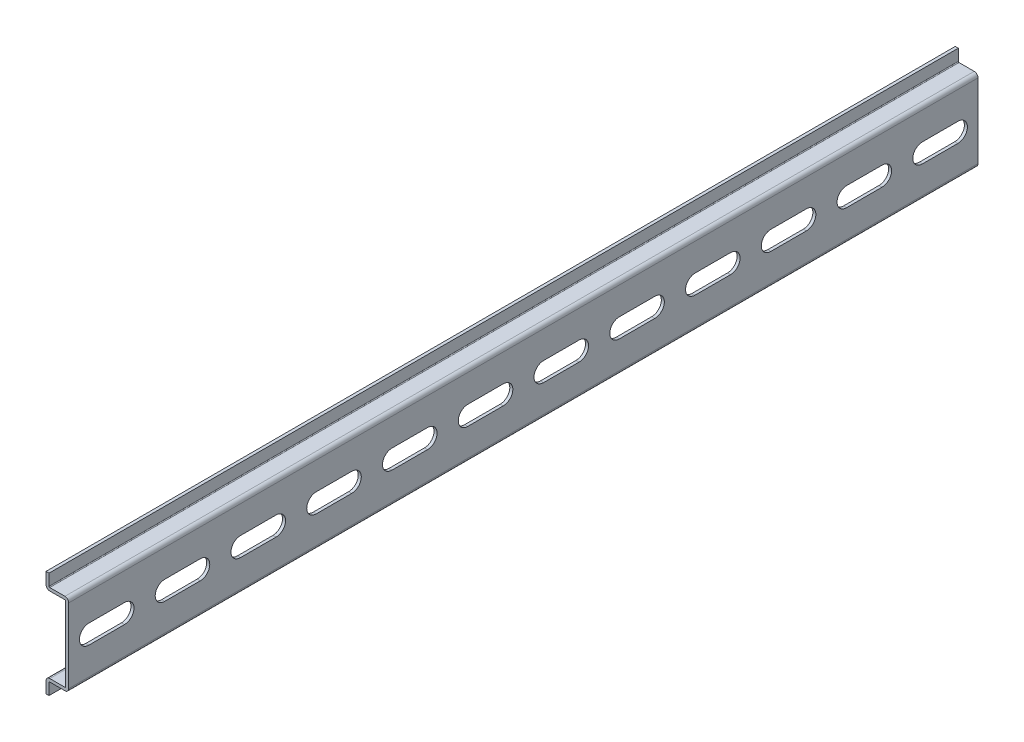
ISO-10303-21;
HEADER;
FILE_DESCRIPTION(('STEP AP214'),'2;1');
FILE_NAME('part.step','',(''),(''),'','','');
FILE_SCHEMA(('AUTOMOTIVE_DESIGN { 1 0 10303 214 1 1 1 1 }'));
ENDSEC;
DATA;
#1=APPLICATION_CONTEXT('core data for automotive mechanical design processes');
#2=APPLICATION_PROTOCOL_DEFINITION('international standard','automotive_design',2000,#1);
#3=PRODUCT_CONTEXT('',#1,'mechanical');
#4=PRODUCT('Part','Part','',(#3));
#5=PRODUCT_RELATED_PRODUCT_CATEGORY('part','',(#4));
#6=PRODUCT_DEFINITION_FORMATION('','',#4);
#7=PRODUCT_DEFINITION_CONTEXT('part definition',#1,'design');
#8=PRODUCT_DEFINITION('design','',#6,#7);
#9=PRODUCT_DEFINITION_SHAPE('','',#8);
#10=(LENGTH_UNIT() NAMED_UNIT(*) SI_UNIT(.MILLI.,.METRE.));
#11=(NAMED_UNIT(*) PLANE_ANGLE_UNIT() SI_UNIT($,.RADIAN.));
#12=(NAMED_UNIT(*) SI_UNIT($,.STERADIAN.) SOLID_ANGLE_UNIT());
#13=UNCERTAINTY_MEASURE_WITH_UNIT(LENGTH_MEASURE(1.E-05),#10,'distance_accuracy_value','');
#14=(GEOMETRIC_REPRESENTATION_CONTEXT(3) GLOBAL_UNCERTAINTY_ASSIGNED_CONTEXT((#13)) GLOBAL_UNIT_ASSIGNED_CONTEXT((#10,
#11,#12)) REPRESENTATION_CONTEXT('',''));
#15=CARTESIAN_POINT('',(0.,0.,0.));
#16=DIRECTION('',(0.,0.,1.));
#17=DIRECTION('',(1.,0.,0.));
#18=AXIS2_PLACEMENT_3D('',#15,#16,#17);
#19=CARTESIAN_POINT('',(-6.5,13.5,300.0375));
#20=DIRECTION('',(-1.,0.,0.));
#21=DIRECTION('',(0.,-1.,0.));
#22=AXIS2_PLACEMENT_3D('',#19,#20,#21);
#23=PLANE('',#22);
#24=DIRECTION('',(0.,1.,0.));
#25=VECTOR('',#24,1.);
#26=CARTESIAN_POINT('',(-6.5,13.5,300.0375));
#27=LINE('',#26,#25);
#28=CARTESIAN_POINT('',(-6.5,13.75,300.0375));
#29=VERTEX_POINT('',#28);
#30=CARTESIAN_POINT('',(-6.5,17.5,300.0375));
#31=VERTEX_POINT('',#30);
#32=EDGE_CURVE('E602',#29,#31,#27,.T.);
#33=ORIENTED_EDGE('',*,*,#32,.F.);
#34=DIRECTION('',(0.,0.,-1.));
#35=VECTOR('',#34,1.);
#36=CARTESIAN_POINT('',(-6.5,13.75,0.));
#37=LINE('',#36,#35);
#38=CARTESIAN_POINT('',(-6.5,13.75,0.));
#39=VERTEX_POINT('',#38);
#40=EDGE_CURVE('E813',#29,#39,#37,.T.);
#41=ORIENTED_EDGE('',*,*,#40,.T.);
#42=DIRECTION('',(0.,1.,0.));
#43=VECTOR('',#42,1.);
#44=CARTESIAN_POINT('',(-6.5,13.5,0.));
#45=LINE('',#44,#43);
#46=CARTESIAN_POINT('',(-6.5,17.5,0.));
#47=VERTEX_POINT('',#46);
#48=EDGE_CURVE('E601',#39,#47,#45,.T.);
#49=ORIENTED_EDGE('',*,*,#48,.T.);
#50=DIRECTION('',(0.,0.,-1.));
#51=VECTOR('',#50,1.);
#52=CARTESIAN_POINT('',(-6.5,17.5,300.0375));
#53=LINE('',#52,#51);
#54=EDGE_CURVE('E669',#31,#47,#53,.T.);
#55=ORIENTED_EDGE('',*,*,#54,.F.);
#56=EDGE_LOOP('',(#33,#41,#49,#55));
#57=FACE_BOUND('',#56,.T.);
#58=ADVANCED_FACE('F35',(#57),#23,.F.);
#59=CARTESIAN_POINT('',(-7.5,17.5,300.0375));
#60=DIRECTION('',(0.,1.,0.));
#61=DIRECTION('',(0.,0.,1.));
#62=AXIS2_PLACEMENT_3D('',#59,#60,#61);
#63=PLANE('',#62);
#64=DIRECTION('',(1.,0.,0.));
#65=VECTOR('',#64,1.);
#66=CARTESIAN_POINT('',(-7.5,17.5,0.));
#67=LINE('',#66,#65);
#68=CARTESIAN_POINT('',(-7.5,17.5,0.));
#69=VERTEX_POINT('',#68);
#70=EDGE_CURVE('E635',#69,#47,#67,.T.);
#71=ORIENTED_EDGE('',*,*,#70,.F.);
#72=DIRECTION('',(0.,0.,-1.));
#73=VECTOR('',#72,1.);
#74=CARTESIAN_POINT('',(-7.5,17.5,300.0375));
#75=LINE('',#74,#73);
#76=CARTESIAN_POINT('',(-7.5,17.5,300.0375));
#77=VERTEX_POINT('',#76);
#78=EDGE_CURVE('E666',#77,#69,#75,.T.);
#79=ORIENTED_EDGE('',*,*,#78,.F.);
#80=DIRECTION('',(1.,0.,0.));
#81=VECTOR('',#80,1.);
#82=CARTESIAN_POINT('',(-7.5,17.5,300.0375));
#83=LINE('',#82,#81);
#84=EDGE_CURVE('E604',#77,#31,#83,.T.);
#85=ORIENTED_EDGE('',*,*,#84,.T.);
#86=ORIENTED_EDGE('',*,*,#54,.T.);
#87=EDGE_LOOP('',(#71,#79,#85,#86));
#88=FACE_BOUND('',#87,.T.);
#89=ADVANCED_FACE('F962',(#88),#63,.T.);
#90=CARTESIAN_POINT('',(-7.5,13.5,300.0375));
#91=DIRECTION('',(-1.,0.,0.));
#92=DIRECTION('',(0.,-1.,0.));
#93=AXIS2_PLACEMENT_3D('',#90,#91,#92);
#94=PLANE('',#93);
#95=DIRECTION('',(0.,1.,0.));
#96=VECTOR('',#95,1.);
#97=CARTESIAN_POINT('',(-7.5,13.5,0.));
#98=LINE('',#97,#96);
#99=CARTESIAN_POINT('',(-7.5,13.75,0.));
#100=VERTEX_POINT('',#99);
#101=EDGE_CURVE('E638',#100,#69,#98,.T.);
#102=ORIENTED_EDGE('',*,*,#101,.F.);
#103=DIRECTION('',(0.,0.,-1.));
#104=VECTOR('',#103,1.);
#105=CARTESIAN_POINT('',(-7.5,13.75,300.0375));
#106=LINE('',#105,#104);
#107=CARTESIAN_POINT('',(-7.5,13.75,300.0375));
#108=VERTEX_POINT('',#107);
#109=EDGE_CURVE('E11',#100,#108,#106,.F.);
#110=ORIENTED_EDGE('',*,*,#109,.T.);
#111=DIRECTION('',(0.,1.,0.));
#112=VECTOR('',#111,1.);
#113=CARTESIAN_POINT('',(-7.5,13.5,300.0375));
#114=LINE('',#113,#112);
#115=EDGE_CURVE('E608',#108,#77,#114,.T.);
#116=ORIENTED_EDGE('',*,*,#115,.T.);
#117=ORIENTED_EDGE('',*,*,#78,.T.);
#118=EDGE_LOOP('',(#102,#110,#116,#117));
#119=FACE_BOUND('',#118,.T.);
#120=ADVANCED_FACE('F966',(#119),#94,.T.);
#121=CARTESIAN_POINT('',(0.,12.5,300.0375));
#122=DIRECTION('',(0.,-1.,0.));
#123=DIRECTION('',(1.,0.,0.));
#124=AXIS2_PLACEMENT_3D('',#121,#122,#123);
#125=PLANE('',#124);
#126=DIRECTION('',(-1.,0.,0.));
#127=VECTOR('',#126,1.);
#128=CARTESIAN_POINT('',(0.,12.5,300.0375));
#129=LINE('',#128,#127);
#130=CARTESIAN_POINT('',(-1.25,12.5,300.0375));
#131=VERTEX_POINT('',#130);
#132=CARTESIAN_POINT('',(-6.25,12.5,300.0375));
#133=VERTEX_POINT('',#132);
#134=EDGE_CURVE('E610',#131,#133,#129,.T.);
#135=ORIENTED_EDGE('',*,*,#134,.T.);
#136=DIRECTION('',(0.,0.,-1.));
#137=VECTOR('',#136,1.);
#138=CARTESIAN_POINT('',(-6.25,12.5,300.0375));
#139=LINE('',#138,#137);
#140=CARTESIAN_POINT('',(-6.25,12.5,0.));
#141=VERTEX_POINT('',#140);
#142=EDGE_CURVE('E43',#133,#141,#139,.T.);
#143=ORIENTED_EDGE('',*,*,#142,.T.);
#144=DIRECTION('',(-1.,0.,0.));
#145=VECTOR('',#144,1.);
#146=CARTESIAN_POINT('',(0.,12.5,0.));
#147=LINE('',#146,#145);
#148=CARTESIAN_POINT('',(-1.25,12.5,0.));
#149=VERTEX_POINT('',#148);
#150=EDGE_CURVE('E640',#149,#141,#147,.T.);
#151=ORIENTED_EDGE('',*,*,#150,.F.);
#152=DIRECTION('',(0.,0.,-1.));
#153=VECTOR('',#152,1.);
#154=CARTESIAN_POINT('',(-1.25,12.5,300.0375));
#155=LINE('',#154,#153);
#156=EDGE_CURVE('E829',#149,#131,#155,.F.);
#157=ORIENTED_EDGE('',*,*,#156,.T.);
#158=EDGE_LOOP('',(#135,#143,#151,#157));
#159=FACE_BOUND('',#158,.T.);
#160=ADVANCED_FACE('F884',(#159),#125,.T.);
#161=CARTESIAN_POINT('',(-1.,-13.5,300.0375));
#162=DIRECTION('',(-1.,0.,0.));
#163=DIRECTION('',(0.,-1.,0.));
#164=AXIS2_PLACEMENT_3D('',#161,#162,#163);
#165=PLANE('',#164);
#166=CARTESIAN_POINT('',(-1.,0.,31.65));
#167=DIRECTION('',(-1.,0.,0.));
#168=DIRECTION('',(0.,-1.,0.));
#169=AXIS2_PLACEMENT_3D('',#166,#167,#168);
#170=CIRCLE('',#169,3.14999999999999);
#171=CARTESIAN_POINT('',(-1.00000000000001,3.14999999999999,31.65));
#172=VERTEX_POINT('',#171);
#173=CARTESIAN_POINT('',(-1.,-3.15,31.65));
#174=VERTEX_POINT('',#173);
#175=EDGE_CURVE('E579',#172,#174,#170,.T.);
#176=ORIENTED_EDGE('',*,*,#175,.F.);
#177=DIRECTION('',(0.,0.,-1.));
#178=VECTOR('',#177,1.);
#179=CARTESIAN_POINT('',(-1.,3.15000000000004,300.0375));
#180=LINE('',#179,#178);
#181=CARTESIAN_POINT('',(-1.,3.14999999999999,43.35));
#182=VERTEX_POINT('',#181);
#183=EDGE_CURVE('E572',#182,#172,#180,.T.);
#184=ORIENTED_EDGE('',*,*,#183,.F.);
#185=CARTESIAN_POINT('',(-1.,0.,43.35));
#186=DIRECTION('',(-1.,0.,0.));
#187=DIRECTION('',(0.,-1.,0.));
#188=AXIS2_PLACEMENT_3D('',#185,#186,#187);
#189=CIRCLE('',#188,3.14999999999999);
#190=CARTESIAN_POINT('',(-1.,-3.15,43.35));
#191=VERTEX_POINT('',#190);
#192=EDGE_CURVE('E574',#191,#182,#189,.T.);
#193=ORIENTED_EDGE('',*,*,#192,.F.);
#194=DIRECTION('',(0.,0.,1.));
#195=VECTOR('',#194,1.);
#196=CARTESIAN_POINT('',(-1.,-3.14999999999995,300.0375));
#197=LINE('',#196,#195);
#198=EDGE_CURVE('E577',#174,#191,#197,.T.);
#199=ORIENTED_EDGE('',*,*,#198,.F.);
#200=EDGE_LOOP('',(#176,#184,#193,#199));
#201=FACE_BOUND('',#200,.T.);
#202=CARTESIAN_POINT('',(-1.,0.,56.65));
#203=DIRECTION('',(-1.,0.,0.));
#204=DIRECTION('',(0.,-1.,0.));
#205=AXIS2_PLACEMENT_3D('',#202,#203,#204);
#206=CIRCLE('',#205,3.14999999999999);
#207=CARTESIAN_POINT('',(-1.00000000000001,3.14999999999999,56.65));
#208=VERTEX_POINT('',#207);
#209=CARTESIAN_POINT('',(-1.,-3.15,56.65));
#210=VERTEX_POINT('',#209);
#211=EDGE_CURVE('E570',#208,#210,#206,.T.);
#212=ORIENTED_EDGE('',*,*,#211,.F.);
#213=DIRECTION('',(0.,0.,-1.));
#214=VECTOR('',#213,1.);
#215=CARTESIAN_POINT('',(-1.,3.15000000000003,300.0375));
#216=LINE('',#215,#214);
#217=CARTESIAN_POINT('',(-1.,3.14999999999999,68.35));
#218=VERTEX_POINT('',#217);
#219=EDGE_CURVE('E563',#218,#208,#216,.T.);
#220=ORIENTED_EDGE('',*,*,#219,.F.);
#221=CARTESIAN_POINT('',(-1.,0.,68.35));
#222=DIRECTION('',(-1.,0.,0.));
#223=DIRECTION('',(0.,-1.,0.));
#224=AXIS2_PLACEMENT_3D('',#221,#222,#223);
#225=CIRCLE('',#224,3.14999999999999);
#226=CARTESIAN_POINT('',(-1.,-3.15,68.35));
#227=VERTEX_POINT('',#226);
#228=EDGE_CURVE('E565',#227,#218,#225,.T.);
#229=ORIENTED_EDGE('',*,*,#228,.F.);
#230=DIRECTION('',(0.,0.,1.));
#231=VECTOR('',#230,1.);
#232=CARTESIAN_POINT('',(-1.,-3.14999999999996,300.0375));
#233=LINE('',#232,#231);
#234=EDGE_CURVE('E568',#210,#227,#233,.T.);
#235=ORIENTED_EDGE('',*,*,#234,.F.);
#236=EDGE_LOOP('',(#212,#220,#229,#235));
#237=FACE_BOUND('',#236,.T.);
#238=CARTESIAN_POINT('',(-1.,0.,81.65));
#239=DIRECTION('',(-1.,0.,0.));
#240=DIRECTION('',(0.,-1.,0.));
#241=AXIS2_PLACEMENT_3D('',#238,#239,#240);
#242=CIRCLE('',#241,3.14999999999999);
#243=CARTESIAN_POINT('',(-1.00000000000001,3.14999999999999,81.65));
#244=VERTEX_POINT('',#243);
#245=CARTESIAN_POINT('',(-1.,-3.15,81.65));
#246=VERTEX_POINT('',#245);
#247=EDGE_CURVE('E561',#244,#246,#242,.T.);
#248=ORIENTED_EDGE('',*,*,#247,.F.);
#249=DIRECTION('',(0.,0.,-1.));
#250=VECTOR('',#249,1.);
#251=CARTESIAN_POINT('',(-1.,3.15000000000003,300.0375));
#252=LINE('',#251,#250);
#253=CARTESIAN_POINT('',(-1.,3.14999999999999,93.35));
#254=VERTEX_POINT('',#253);
#255=EDGE_CURVE('E554',#254,#244,#252,.T.);
#256=ORIENTED_EDGE('',*,*,#255,.F.);
#257=CARTESIAN_POINT('',(-1.,0.,93.35));
#258=DIRECTION('',(-1.,0.,0.));
#259=DIRECTION('',(0.,-1.,0.));
#260=AXIS2_PLACEMENT_3D('',#257,#258,#259);
#261=CIRCLE('',#260,3.14999999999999);
#262=CARTESIAN_POINT('',(-1.,-3.15,93.35));
#263=VERTEX_POINT('',#262);
#264=EDGE_CURVE('E556',#263,#254,#261,.T.);
#265=ORIENTED_EDGE('',*,*,#264,.F.);
#266=DIRECTION('',(0.,0.,1.));
#267=VECTOR('',#266,1.);
#268=CARTESIAN_POINT('',(-1.,-3.14999999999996,300.0375));
#269=LINE('',#268,#267);
#270=EDGE_CURVE('E559',#246,#263,#269,.T.);
#271=ORIENTED_EDGE('',*,*,#270,.F.);
#272=EDGE_LOOP('',(#248,#256,#265,#271));
#273=FACE_BOUND('',#272,.T.);
#274=CARTESIAN_POINT('',(-1.,0.,106.65));
#275=DIRECTION('',(-1.,0.,0.));
#276=DIRECTION('',(0.,-1.,0.));
#277=AXIS2_PLACEMENT_3D('',#274,#275,#276);
#278=CIRCLE('',#277,3.14999999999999);
#279=CARTESIAN_POINT('',(-1.00000000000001,3.14999999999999,106.65));
#280=VERTEX_POINT('',#279);
#281=CARTESIAN_POINT('',(-1.,-3.15,106.65));
#282=VERTEX_POINT('',#281);
#283=EDGE_CURVE('E552',#280,#282,#278,.T.);
#284=ORIENTED_EDGE('',*,*,#283,.F.);
#285=DIRECTION('',(0.,0.,-1.));
#286=VECTOR('',#285,1.);
#287=CARTESIAN_POINT('',(-1.,3.15000000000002,300.0375));
#288=LINE('',#287,#286);
#289=CARTESIAN_POINT('',(-1.,3.14999999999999,118.35));
#290=VERTEX_POINT('',#289);
#291=EDGE_CURVE('E545',#290,#280,#288,.T.);
#292=ORIENTED_EDGE('',*,*,#291,.F.);
#293=CARTESIAN_POINT('',(-1.,0.,118.35));
#294=DIRECTION('',(-1.,0.,0.));
#295=DIRECTION('',(0.,-1.,0.));
#296=AXIS2_PLACEMENT_3D('',#293,#294,#295);
#297=CIRCLE('',#296,3.14999999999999);
#298=CARTESIAN_POINT('',(-1.,-3.15,118.35));
#299=VERTEX_POINT('',#298);
#300=EDGE_CURVE('E547',#299,#290,#297,.T.);
#301=ORIENTED_EDGE('',*,*,#300,.F.);
#302=DIRECTION('',(0.,0.,1.));
#303=VECTOR('',#302,1.);
#304=CARTESIAN_POINT('',(-1.,-3.14999999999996,300.0375));
#305=LINE('',#304,#303);
#306=EDGE_CURVE('E550',#282,#299,#305,.T.);
#307=ORIENTED_EDGE('',*,*,#306,.F.);
#308=EDGE_LOOP('',(#284,#292,#301,#307));
#309=FACE_BOUND('',#308,.T.);
#310=CARTESIAN_POINT('',(-1.,0.,131.65));
#311=DIRECTION('',(-1.,0.,0.));
#312=DIRECTION('',(0.,-1.,0.));
#313=AXIS2_PLACEMENT_3D('',#310,#311,#312);
#314=CIRCLE('',#313,3.14999999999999);
#315=CARTESIAN_POINT('',(-1.00000000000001,3.14999999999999,131.65));
#316=VERTEX_POINT('',#315);
#317=CARTESIAN_POINT('',(-1.,-3.15,131.65));
#318=VERTEX_POINT('',#317);
#319=EDGE_CURVE('E543',#316,#318,#314,.T.);
#320=ORIENTED_EDGE('',*,*,#319,.F.);
#321=DIRECTION('',(0.,0.,-1.));
#322=VECTOR('',#321,1.);
#323=CARTESIAN_POINT('',(-1.,3.15000000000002,300.0375));
#324=LINE('',#323,#322);
#325=CARTESIAN_POINT('',(-1.,3.14999999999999,143.35));
#326=VERTEX_POINT('',#325);
#327=EDGE_CURVE('E536',#326,#316,#324,.T.);
#328=ORIENTED_EDGE('',*,*,#327,.F.);
#329=CARTESIAN_POINT('',(-1.,0.,143.35));
#330=DIRECTION('',(-1.,0.,0.));
#331=DIRECTION('',(0.,-1.,0.));
#332=AXIS2_PLACEMENT_3D('',#329,#330,#331);
#333=CIRCLE('',#332,3.14999999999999);
#334=CARTESIAN_POINT('',(-1.,-3.15,143.35));
#335=VERTEX_POINT('',#334);
#336=EDGE_CURVE('E538',#335,#326,#333,.T.);
#337=ORIENTED_EDGE('',*,*,#336,.F.);
#338=DIRECTION('',(0.,0.,1.));
#339=VECTOR('',#338,1.);
#340=CARTESIAN_POINT('',(-1.,-3.14999999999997,300.0375));
#341=LINE('',#340,#339);
#342=EDGE_CURVE('E541',#318,#335,#341,.T.);
#343=ORIENTED_EDGE('',*,*,#342,.F.);
#344=EDGE_LOOP('',(#320,#328,#337,#343));
#345=FACE_BOUND('',#344,.T.);
#346=CARTESIAN_POINT('',(-1.,0.,156.65));
#347=DIRECTION('',(-1.,0.,0.));
#348=DIRECTION('',(0.,-1.,0.));
#349=AXIS2_PLACEMENT_3D('',#346,#347,#348);
#350=CIRCLE('',#349,3.14999999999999);
#351=CARTESIAN_POINT('',(-1.00000000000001,3.14999999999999,156.65));
#352=VERTEX_POINT('',#351);
#353=CARTESIAN_POINT('',(-1.,-3.15,156.65));
#354=VERTEX_POINT('',#353);
#355=EDGE_CURVE('E534',#352,#354,#350,.T.);
#356=ORIENTED_EDGE('',*,*,#355,.F.);
#357=DIRECTION('',(0.,0.,-1.));
#358=VECTOR('',#357,1.);
#359=CARTESIAN_POINT('',(-1.,3.15000000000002,300.0375));
#360=LINE('',#359,#358);
#361=CARTESIAN_POINT('',(-1.,3.14999999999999,168.35));
#362=VERTEX_POINT('',#361);
#363=EDGE_CURVE('E527',#362,#352,#360,.T.);
#364=ORIENTED_EDGE('',*,*,#363,.F.);
#365=CARTESIAN_POINT('',(-1.,0.,168.35));
#366=DIRECTION('',(-1.,0.,0.));
#367=DIRECTION('',(0.,-1.,0.));
#368=AXIS2_PLACEMENT_3D('',#365,#366,#367);
#369=CIRCLE('',#368,3.14999999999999);
#370=CARTESIAN_POINT('',(-1.,-3.15,168.35));
#371=VERTEX_POINT('',#370);
#372=EDGE_CURVE('E529',#371,#362,#369,.T.);
#373=ORIENTED_EDGE('',*,*,#372,.F.);
#374=DIRECTION('',(0.,0.,1.));
#375=VECTOR('',#374,1.);
#376=CARTESIAN_POINT('',(-1.,-3.14999999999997,300.0375));
#377=LINE('',#376,#375);
#378=EDGE_CURVE('E532',#354,#371,#377,.T.);
#379=ORIENTED_EDGE('',*,*,#378,.F.);
#380=EDGE_LOOP('',(#356,#364,#373,#379));
#381=FACE_BOUND('',#380,.T.);
#382=CARTESIAN_POINT('',(-1.,0.,181.65));
#383=DIRECTION('',(-1.,0.,0.));
#384=DIRECTION('',(0.,-1.,0.));
#385=AXIS2_PLACEMENT_3D('',#382,#383,#384);
#386=CIRCLE('',#385,3.14999999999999);
#387=CARTESIAN_POINT('',(-1.00000000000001,3.14999999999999,181.65));
#388=VERTEX_POINT('',#387);
#389=CARTESIAN_POINT('',(-1.,-3.15,181.65));
#390=VERTEX_POINT('',#389);
#391=EDGE_CURVE('E525',#388,#390,#386,.T.);
#392=ORIENTED_EDGE('',*,*,#391,.F.);
#393=DIRECTION('',(0.,0.,-1.));
#394=VECTOR('',#393,1.);
#395=CARTESIAN_POINT('',(-1.,3.15000000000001,300.0375));
#396=LINE('',#395,#394);
#397=CARTESIAN_POINT('',(-1.,3.14999999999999,193.35));
#398=VERTEX_POINT('',#397);
#399=EDGE_CURVE('E518',#398,#388,#396,.T.);
#400=ORIENTED_EDGE('',*,*,#399,.F.);
#401=CARTESIAN_POINT('',(-1.,0.,193.35));
#402=DIRECTION('',(-1.,0.,0.));
#403=DIRECTION('',(0.,-1.,0.));
#404=AXIS2_PLACEMENT_3D('',#401,#402,#403);
#405=CIRCLE('',#404,3.14999999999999);
#406=CARTESIAN_POINT('',(-1.,-3.15,193.35));
#407=VERTEX_POINT('',#406);
#408=EDGE_CURVE('E520',#407,#398,#405,.T.);
#409=ORIENTED_EDGE('',*,*,#408,.F.);
#410=DIRECTION('',(0.,0.,1.));
#411=VECTOR('',#410,1.);
#412=CARTESIAN_POINT('',(-1.,-3.14999999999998,300.0375));
#413=LINE('',#412,#411);
#414=EDGE_CURVE('E523',#390,#407,#413,.T.);
#415=ORIENTED_EDGE('',*,*,#414,.F.);
#416=EDGE_LOOP('',(#392,#400,#409,#415));
#417=FACE_BOUND('',#416,.T.);
#418=CARTESIAN_POINT('',(-1.,0.,206.65));
#419=DIRECTION('',(-1.,0.,0.));
#420=DIRECTION('',(0.,-1.,0.));
#421=AXIS2_PLACEMENT_3D('',#418,#419,#420);
#422=CIRCLE('',#421,3.14999999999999);
#423=CARTESIAN_POINT('',(-1.00000000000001,3.14999999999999,206.65));
#424=VERTEX_POINT('',#423);
#425=CARTESIAN_POINT('',(-1.,-3.15,206.65));
#426=VERTEX_POINT('',#425);
#427=EDGE_CURVE('E516',#424,#426,#422,.T.);
#428=ORIENTED_EDGE('',*,*,#427,.F.);
#429=DIRECTION('',(0.,0.,-1.));
#430=VECTOR('',#429,1.);
#431=CARTESIAN_POINT('',(-1.,3.15000000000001,300.0375));
#432=LINE('',#431,#430);
#433=CARTESIAN_POINT('',(-1.,3.14999999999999,218.35));
#434=VERTEX_POINT('',#433);
#435=EDGE_CURVE('E509',#434,#424,#432,.T.);
#436=ORIENTED_EDGE('',*,*,#435,.F.);
#437=CARTESIAN_POINT('',(-1.,0.,218.35));
#438=DIRECTION('',(-1.,0.,0.));
#439=DIRECTION('',(0.,-1.,0.));
#440=AXIS2_PLACEMENT_3D('',#437,#438,#439);
#441=CIRCLE('',#440,3.14999999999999);
#442=CARTESIAN_POINT('',(-1.,-3.15,218.35));
#443=VERTEX_POINT('',#442);
#444=EDGE_CURVE('E511',#443,#434,#441,.T.);
#445=ORIENTED_EDGE('',*,*,#444,.F.);
#446=DIRECTION('',(0.,0.,1.));
#447=VECTOR('',#446,1.);
#448=CARTESIAN_POINT('',(-1.,-3.14999999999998,300.0375));
#449=LINE('',#448,#447);
#450=EDGE_CURVE('E514',#426,#443,#449,.T.);
#451=ORIENTED_EDGE('',*,*,#450,.F.);
#452=EDGE_LOOP('',(#428,#436,#445,#451));
#453=FACE_BOUND('',#452,.T.);
#454=CARTESIAN_POINT('',(-1.,0.,231.65));
#455=DIRECTION('',(-1.,0.,0.));
#456=DIRECTION('',(0.,-1.,0.));
#457=AXIS2_PLACEMENT_3D('',#454,#455,#456);
#458=CIRCLE('',#457,3.14999999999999);
#459=CARTESIAN_POINT('',(-1.00000000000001,3.14999999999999,231.65));
#460=VERTEX_POINT('',#459);
#461=CARTESIAN_POINT('',(-1.,-3.15,231.65));
#462=VERTEX_POINT('',#461);
#463=EDGE_CURVE('E507',#460,#462,#458,.T.);
#464=ORIENTED_EDGE('',*,*,#463,.F.);
#465=DIRECTION('',(0.,0.,-1.));
#466=VECTOR('',#465,1.);
#467=CARTESIAN_POINT('',(-1.,3.15,300.0375));
#468=LINE('',#467,#466);
#469=CARTESIAN_POINT('',(-1.,3.14999999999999,243.35));
#470=VERTEX_POINT('',#469);
#471=EDGE_CURVE('E500',#470,#460,#468,.T.);
#472=ORIENTED_EDGE('',*,*,#471,.F.);
#473=CARTESIAN_POINT('',(-1.,0.,243.35));
#474=DIRECTION('',(-1.,0.,0.));
#475=DIRECTION('',(0.,-1.,0.));
#476=AXIS2_PLACEMENT_3D('',#473,#474,#475);
#477=CIRCLE('',#476,3.14999999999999);
#478=CARTESIAN_POINT('',(-1.,-3.15,243.35));
#479=VERTEX_POINT('',#478);
#480=EDGE_CURVE('E502',#479,#470,#477,.T.);
#481=ORIENTED_EDGE('',*,*,#480,.F.);
#482=DIRECTION('',(0.,0.,1.));
#483=VECTOR('',#482,1.);
#484=CARTESIAN_POINT('',(-1.,-3.14999999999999,300.0375));
#485=LINE('',#484,#483);
#486=EDGE_CURVE('E505',#462,#479,#485,.T.);
#487=ORIENTED_EDGE('',*,*,#486,.F.);
#488=EDGE_LOOP('',(#464,#472,#481,#487));
#489=FACE_BOUND('',#488,.T.);
#490=CARTESIAN_POINT('',(-1.,0.,256.65));
#491=DIRECTION('',(-1.,0.,0.));
#492=DIRECTION('',(0.,-1.,0.));
#493=AXIS2_PLACEMENT_3D('',#490,#491,#492);
#494=CIRCLE('',#493,3.14999999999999);
#495=CARTESIAN_POINT('',(-1.00000000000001,3.14999999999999,256.65));
#496=VERTEX_POINT('',#495);
#497=CARTESIAN_POINT('',(-1.,-3.15,256.65));
#498=VERTEX_POINT('',#497);
#499=EDGE_CURVE('E498',#496,#498,#494,.T.);
#500=ORIENTED_EDGE('',*,*,#499,.F.);
#501=DIRECTION('',(0.,0.,-1.));
#502=VECTOR('',#501,1.);
#503=CARTESIAN_POINT('',(-1.,3.15,300.0375));
#504=LINE('',#503,#502);
#505=CARTESIAN_POINT('',(-1.,3.14999999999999,268.35));
#506=VERTEX_POINT('',#505);
#507=EDGE_CURVE('E487',#506,#496,#504,.T.);
#508=ORIENTED_EDGE('',*,*,#507,.F.);
#509=CARTESIAN_POINT('',(-1.,0.,268.35));
#510=DIRECTION('',(-1.,0.,0.));
#511=DIRECTION('',(0.,-1.,0.));
#512=AXIS2_PLACEMENT_3D('',#509,#510,#511);
#513=CIRCLE('',#512,3.14999999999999);
#514=CARTESIAN_POINT('',(-1.,-3.15,268.35));
#515=VERTEX_POINT('',#514);
#516=EDGE_CURVE('E489',#515,#506,#513,.T.);
#517=ORIENTED_EDGE('',*,*,#516,.F.);
#518=DIRECTION('',(0.,0.,1.));
#519=VECTOR('',#518,1.);
#520=CARTESIAN_POINT('',(-1.,-3.14999999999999,300.0375));
#521=LINE('',#520,#519);
#522=EDGE_CURVE('E496',#498,#515,#521,.T.);
#523=ORIENTED_EDGE('',*,*,#522,.F.);
#524=EDGE_LOOP('',(#500,#508,#517,#523));
#525=FACE_BOUND('',#524,.T.);
#526=CARTESIAN_POINT('',(-1.,0.,281.65));
#527=DIRECTION('',(-1.,0.,0.));
#528=DIRECTION('',(0.,-1.,0.));
#529=AXIS2_PLACEMENT_3D('',#526,#527,#528);
#530=CIRCLE('',#529,3.14999999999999);
#531=CARTESIAN_POINT('',(-1.00000000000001,3.14999999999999,281.65));
#532=VERTEX_POINT('',#531);
#533=CARTESIAN_POINT('',(-1.,-3.15,281.65));
#534=VERTEX_POINT('',#533);
#535=EDGE_CURVE('E477',#532,#534,#530,.T.);
#536=ORIENTED_EDGE('',*,*,#535,.F.);
#537=DIRECTION('',(0.,0.,-1.));
#538=VECTOR('',#537,1.);
#539=CARTESIAN_POINT('',(-1.,3.14999999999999,300.0375));
#540=LINE('',#539,#538);
#541=CARTESIAN_POINT('',(-1.,3.14999999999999,293.35));
#542=VERTEX_POINT('',#541);
#543=EDGE_CURVE('E460',#542,#532,#540,.T.);
#544=ORIENTED_EDGE('',*,*,#543,.F.);
#545=CARTESIAN_POINT('',(-1.,0.,293.35));
#546=DIRECTION('',(-1.,0.,0.));
#547=DIRECTION('',(0.,-1.,0.));
#548=AXIS2_PLACEMENT_3D('',#545,#546,#547);
#549=CIRCLE('',#548,3.14999999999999);
#550=CARTESIAN_POINT('',(-1.,-3.15,293.35));
#551=VERTEX_POINT('',#550);
#552=EDGE_CURVE('E471',#551,#542,#549,.T.);
#553=ORIENTED_EDGE('',*,*,#552,.F.);
#554=DIRECTION('',(0.,0.,1.));
#555=VECTOR('',#554,1.);
#556=CARTESIAN_POINT('',(-1.,-3.15,300.0375));
#557=LINE('',#556,#555);
#558=EDGE_CURVE('E486',#534,#551,#557,.T.);
#559=ORIENTED_EDGE('',*,*,#558,.F.);
#560=EDGE_LOOP('',(#536,#544,#553,#559));
#561=FACE_BOUND('',#560,.T.);
#562=CARTESIAN_POINT('',(-1.,0.,6.65));
#563=DIRECTION('',(-1.,0.,0.));
#564=DIRECTION('',(0.,-1.,0.));
#565=AXIS2_PLACEMENT_3D('',#562,#563,#564);
#566=CIRCLE('',#565,3.14999999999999);
#567=CARTESIAN_POINT('',(-1.00000000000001,3.14999999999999,6.65));
#568=VERTEX_POINT('',#567);
#569=CARTESIAN_POINT('',(-1.,-3.15,6.65));
#570=VERTEX_POINT('',#569);
#571=EDGE_CURVE('E599',#568,#570,#566,.T.);
#572=ORIENTED_EDGE('',*,*,#571,.F.);
#573=DIRECTION('',(0.,0.,-1.));
#574=VECTOR('',#573,1.);
#575=CARTESIAN_POINT('',(-1.,3.15000000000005,300.0375));
#576=LINE('',#575,#574);
#577=CARTESIAN_POINT('',(-1.,3.14999999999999,18.35));
#578=VERTEX_POINT('',#577);
#579=EDGE_CURVE('E589',#578,#568,#576,.T.);
#580=ORIENTED_EDGE('',*,*,#579,.F.);
#581=CARTESIAN_POINT('',(-1.,0.,18.35));
#582=DIRECTION('',(-1.,0.,0.));
#583=DIRECTION('',(0.,-1.,0.));
#584=AXIS2_PLACEMENT_3D('',#581,#582,#583);
#585=CIRCLE('',#584,3.14999999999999);
#586=CARTESIAN_POINT('',(-1.,-3.15,18.35));
#587=VERTEX_POINT('',#586);
#588=EDGE_CURVE('E594',#587,#578,#585,.T.);
#589=ORIENTED_EDGE('',*,*,#588,.F.);
#590=DIRECTION('',(0.,0.,1.));
#591=VECTOR('',#590,1.);
#592=CARTESIAN_POINT('',(-1.,-3.14999999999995,300.0375));
#593=LINE('',#592,#591);
#594=EDGE_CURVE('E597',#570,#587,#593,.T.);
#595=ORIENTED_EDGE('',*,*,#594,.F.);
#596=EDGE_LOOP('',(#572,#580,#589,#595));
#597=FACE_BOUND('',#596,.T.);
#598=DIRECTION('',(0.,1.,0.));
#599=VECTOR('',#598,1.);
#600=CARTESIAN_POINT('',(-1.,-13.5,300.0375));
#601=LINE('',#600,#599);
#602=CARTESIAN_POINT('',(-1.,-12.25,300.0375));
#603=VERTEX_POINT('',#602);
#604=CARTESIAN_POINT('',(-1.,12.25,300.0375));
#605=VERTEX_POINT('',#604);
#606=EDGE_CURVE('E613',#603,#605,#601,.T.);
#607=ORIENTED_EDGE('',*,*,#606,.T.);
#608=DIRECTION('',(0.,0.,-1.));
#609=VECTOR('',#608,1.);
#610=CARTESIAN_POINT('',(-1.,12.25,0.));
#611=LINE('',#610,#609);
#612=CARTESIAN_POINT('',(-1.,12.25,0.));
#613=VERTEX_POINT('',#612);
#614=EDGE_CURVE('E826',#605,#613,#611,.T.);
#615=ORIENTED_EDGE('',*,*,#614,.T.);
#616=DIRECTION('',(0.,1.,0.));
#617=VECTOR('',#616,1.);
#618=CARTESIAN_POINT('',(-1.,-13.5,0.));
#619=LINE('',#618,#617);
#620=CARTESIAN_POINT('',(-1.,-12.25,0.));
#621=VERTEX_POINT('',#620);
#622=EDGE_CURVE('E643',#621,#613,#619,.T.);
#623=ORIENTED_EDGE('',*,*,#622,.F.);
#624=DIRECTION('',(0.,0.,-1.));
#625=VECTOR('',#624,1.);
#626=CARTESIAN_POINT('',(-1.,-12.25,300.0375));
#627=LINE('',#626,#625);
#628=EDGE_CURVE('E824',#621,#603,#627,.F.);
#629=ORIENTED_EDGE('',*,*,#628,.T.);
#630=EDGE_LOOP('',(#607,#615,#623,#629));
#631=FACE_BOUND('',#630,.T.);
#632=ADVANCED_FACE('F484',(#201,#237,#273,#309,#345,#381,#417,#453,#489,#525,#561,#597,#631),
#165,.T.);
#633=CARTESIAN_POINT('',(0.,-12.5,300.0375));
#634=DIRECTION('',(0.,1.,0.));
#635=DIRECTION('',(-1.,0.,0.));
#636=AXIS2_PLACEMENT_3D('',#633,#634,#635);
#637=PLANE('',#636);
#638=DIRECTION('',(1.,0.,0.));
#639=VECTOR('',#638,1.);
#640=CARTESIAN_POINT('',(0.,-12.5,0.));
#641=LINE('',#640,#639);
#642=CARTESIAN_POINT('',(-6.25,-12.5,0.));
#643=VERTEX_POINT('',#642);
#644=CARTESIAN_POINT('',(-1.25,-12.5,0.));
#645=VERTEX_POINT('',#644);
#646=EDGE_CURVE('E646',#643,#645,#641,.T.);
#647=ORIENTED_EDGE('',*,*,#646,.F.);
#648=DIRECTION('',(0.,0.,-1.));
#649=VECTOR('',#648,1.);
#650=CARTESIAN_POINT('',(-6.25,-12.5,300.0375));
#651=LINE('',#650,#649);
#652=CARTESIAN_POINT('',(-6.25,-12.5,300.0375));
#653=VERTEX_POINT('',#652);
#654=EDGE_CURVE('E863',#643,#653,#651,.F.);
#655=ORIENTED_EDGE('',*,*,#654,.T.);
#656=DIRECTION('',(1.,0.,0.));
#657=VECTOR('',#656,1.);
#658=CARTESIAN_POINT('',(0.,-12.5,300.0375));
#659=LINE('',#658,#657);
#660=CARTESIAN_POINT('',(-1.25,-12.5,300.0375));
#661=VERTEX_POINT('',#660);
#662=EDGE_CURVE('E616',#653,#661,#659,.T.);
#663=ORIENTED_EDGE('',*,*,#662,.T.);
#664=DIRECTION('',(0.,0.,-1.));
#665=VECTOR('',#664,1.);
#666=CARTESIAN_POINT('',(-1.25,-12.5,0.));
#667=LINE('',#666,#665);
#668=EDGE_CURVE('E831',#661,#645,#667,.T.);
#669=ORIENTED_EDGE('',*,*,#668,.T.);
#670=EDGE_LOOP('',(#647,#655,#663,#669));
#671=FACE_BOUND('',#670,.T.);
#672=ADVANCED_FACE('F909',(#671),#637,.T.);
#673=CARTESIAN_POINT('',(-7.5,-13.5,300.0375));
#674=DIRECTION('',(-1.,0.,0.));
#675=DIRECTION('',(0.,-1.,0.));
#676=AXIS2_PLACEMENT_3D('',#673,#674,#675);
#677=PLANE('',#676);
#678=DIRECTION('',(0.,1.,0.));
#679=VECTOR('',#678,1.);
#680=CARTESIAN_POINT('',(-7.5,-13.5,300.0375));
#681=LINE('',#680,#679);
#682=CARTESIAN_POINT('',(-7.5,-17.5,300.0375));
#683=VERTEX_POINT('',#682);
#684=CARTESIAN_POINT('',(-7.5,-13.75,300.0375));
#685=VERTEX_POINT('',#684);
#686=EDGE_CURVE('E618',#683,#685,#681,.T.);
#687=ORIENTED_EDGE('',*,*,#686,.T.);
#688=DIRECTION('',(0.,0.,-1.));
#689=VECTOR('',#688,1.);
#690=CARTESIAN_POINT('',(-7.5,-13.75,300.0375));
#691=LINE('',#690,#689);
#692=CARTESIAN_POINT('',(-7.5,-13.75,0.));
#693=VERTEX_POINT('',#692);
#694=EDGE_CURVE('E852',#685,#693,#691,.T.);
#695=ORIENTED_EDGE('',*,*,#694,.T.);
#696=DIRECTION('',(0.,1.,0.));
#697=VECTOR('',#696,1.);
#698=CARTESIAN_POINT('',(-7.5,-13.5,0.));
#699=LINE('',#698,#697);
#700=CARTESIAN_POINT('',(-7.5,-17.5,0.));
#701=VERTEX_POINT('',#700);
#702=EDGE_CURVE('E648',#701,#693,#699,.T.);
#703=ORIENTED_EDGE('',*,*,#702,.F.);
#704=DIRECTION('',(0.,0.,-1.));
#705=VECTOR('',#704,1.);
#706=CARTESIAN_POINT('',(-7.5,-17.5,300.0375));
#707=LINE('',#706,#705);
#708=EDGE_CURVE('E664',#683,#701,#707,.T.);
#709=ORIENTED_EDGE('',*,*,#708,.F.);
#710=EDGE_LOOP('',(#687,#695,#703,#709));
#711=FACE_BOUND('',#710,.T.);
#712=ADVANCED_FACE('F918',(#711),#677,.T.);
#713=CARTESIAN_POINT('',(-6.5,-17.5,300.0375));
#714=DIRECTION('',(0.,-1.,0.));
#715=DIRECTION('',(0.,0.,-1.));
#716=AXIS2_PLACEMENT_3D('',#713,#714,#715);
#717=PLANE('',#716);
#718=DIRECTION('',(-1.,0.,0.));
#719=VECTOR('',#718,1.);
#720=CARTESIAN_POINT('',(-6.5,-17.5,0.));
#721=LINE('',#720,#719);
#722=CARTESIAN_POINT('',(-6.5,-17.5,0.));
#723=VERTEX_POINT('',#722);
#724=EDGE_CURVE('E651',#723,#701,#721,.T.);
#725=ORIENTED_EDGE('',*,*,#724,.F.);
#726=DIRECTION('',(0.,0.,-1.));
#727=VECTOR('',#726,1.);
#728=CARTESIAN_POINT('',(-6.5,-17.5,300.0375));
#729=LINE('',#728,#727);
#730=CARTESIAN_POINT('',(-6.5,-17.5,300.0375));
#731=VERTEX_POINT('',#730);
#732=EDGE_CURVE('E633',#731,#723,#729,.T.);
#733=ORIENTED_EDGE('',*,*,#732,.F.);
#734=DIRECTION('',(-1.,0.,0.));
#735=VECTOR('',#734,1.);
#736=CARTESIAN_POINT('',(-6.5,-17.5,300.0375));
#737=LINE('',#736,#735);
#738=EDGE_CURVE('E621',#731,#683,#737,.T.);
#739=ORIENTED_EDGE('',*,*,#738,.T.);
#740=ORIENTED_EDGE('',*,*,#708,.T.);
#741=EDGE_LOOP('',(#725,#733,#739,#740));
#742=FACE_BOUND('',#741,.T.);
#743=ADVANCED_FACE('F922',(#742),#717,.T.);
#744=CARTESIAN_POINT('',(-6.5,-13.5,300.0375));
#745=DIRECTION('',(-1.,0.,0.));
#746=DIRECTION('',(0.,-1.,0.));
#747=AXIS2_PLACEMENT_3D('',#744,#745,#746);
#748=PLANE('',#747);
#749=DIRECTION('',(0.,1.,0.));
#750=VECTOR('',#749,1.);
#751=CARTESIAN_POINT('',(-6.5,-13.5,0.));
#752=LINE('',#751,#750);
#753=CARTESIAN_POINT('',(-6.5,-13.75,0.));
#754=VERTEX_POINT('',#753);
#755=EDGE_CURVE('E654',#723,#754,#752,.T.);
#756=ORIENTED_EDGE('',*,*,#755,.T.);
#757=DIRECTION('',(0.,0.,-1.));
#758=VECTOR('',#757,1.);
#759=CARTESIAN_POINT('',(-6.5,-13.75,300.0375));
#760=LINE('',#759,#758);
#761=CARTESIAN_POINT('',(-6.5,-13.75,300.0375));
#762=VERTEX_POINT('',#761);
#763=EDGE_CURVE('E822',#754,#762,#760,.F.);
#764=ORIENTED_EDGE('',*,*,#763,.T.);
#765=DIRECTION('',(0.,1.,0.));
#766=VECTOR('',#765,1.);
#767=CARTESIAN_POINT('',(-6.5,-13.5,300.0375));
#768=LINE('',#767,#766);
#769=EDGE_CURVE('E624',#731,#762,#768,.T.);
#770=ORIENTED_EDGE('',*,*,#769,.F.);
#771=ORIENTED_EDGE('',*,*,#732,.T.);
#772=EDGE_LOOP('',(#756,#764,#770,#771));
#773=FACE_BOUND('',#772,.T.);
#774=ADVANCED_FACE('F1060',(#773),#748,.F.);
#775=CARTESIAN_POINT('',(0.,-13.5,300.0375));
#776=DIRECTION('',(0.,1.,0.));
#777=DIRECTION('',(-1.,0.,0.));
#778=AXIS2_PLACEMENT_3D('',#775,#776,#777);
#779=PLANE('',#778);
#780=DIRECTION('',(1.,0.,0.));
#781=VECTOR('',#780,1.);
#782=CARTESIAN_POINT('',(0.,-13.5,0.));
#783=LINE('',#782,#781);
#784=CARTESIAN_POINT('',(-6.25,-13.5,0.));
#785=VERTEX_POINT('',#784);
#786=CARTESIAN_POINT('',(-1.25,-13.5,0.));
#787=VERTEX_POINT('',#786);
#788=EDGE_CURVE('E657',#785,#787,#783,.T.);
#789=ORIENTED_EDGE('',*,*,#788,.T.);
#790=DIRECTION('',(0.,0.,-1.));
#791=VECTOR('',#790,1.);
#792=CARTESIAN_POINT('',(-1.25,-13.5,300.0375));
#793=LINE('',#792,#791);
#794=CARTESIAN_POINT('',(-1.25,-13.5,300.0375));
#795=VERTEX_POINT('',#794);
#796=EDGE_CURVE('E876',#787,#795,#793,.F.);
#797=ORIENTED_EDGE('',*,*,#796,.T.);
#798=DIRECTION('',(1.,0.,0.));
#799=VECTOR('',#798,1.);
#800=CARTESIAN_POINT('',(0.,-13.5,300.0375));
#801=LINE('',#800,#799);
#802=CARTESIAN_POINT('',(-6.25,-13.5,300.0375));
#803=VERTEX_POINT('',#802);
#804=EDGE_CURVE('E627',#803,#795,#801,.T.);
#805=ORIENTED_EDGE('',*,*,#804,.F.);
#806=DIRECTION('',(0.,0.,-1.));
#807=VECTOR('',#806,1.);
#808=CARTESIAN_POINT('',(-6.25,-13.5,0.));
#809=LINE('',#808,#807);
#810=EDGE_CURVE('E819',#803,#785,#809,.T.);
#811=ORIENTED_EDGE('',*,*,#810,.T.);
#812=EDGE_LOOP('',(#789,#797,#805,#811));
#813=FACE_BOUND('',#812,.T.);
#814=ADVANCED_FACE('F934',(#813),#779,.F.);
#815=CARTESIAN_POINT('',(0.,-13.5,300.0375));
#816=DIRECTION('',(-1.,0.,0.));
#817=DIRECTION('',(0.,-1.,0.));
#818=AXIS2_PLACEMENT_3D('',#815,#816,#817);
#819=PLANE('',#818);
#820=DIRECTION('',(0.,0.,1.));
#821=VECTOR('',#820,1.);
#822=CARTESIAN_POINT('',(0.,3.14999999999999,300.0375));
#823=LINE('',#822,#821);
#824=CARTESIAN_POINT('',(0.,3.15,43.35));
#825=VERTEX_POINT('',#824);
#826=CARTESIAN_POINT('',(0.,3.14999999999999,31.65));
#827=VERTEX_POINT('',#826);
#828=EDGE_CURVE('E801',#825,#827,#823,.F.);
#829=ORIENTED_EDGE('',*,*,#828,.T.);
#830=CARTESIAN_POINT('',(0.,0.,31.65));
#831=DIRECTION('',(1.,0.,0.));
#832=DIRECTION('',(0.,0.,-1.));
#833=AXIS2_PLACEMENT_3D('',#830,#831,#832);
#834=CIRCLE('',#833,3.14999999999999);
#835=CARTESIAN_POINT('',(0.,-3.15,31.65));
#836=VERTEX_POINT('',#835);
#837=EDGE_CURVE('E810',#827,#836,#834,.F.);
#838=ORIENTED_EDGE('',*,*,#837,.T.);
#839=DIRECTION('',(0.,0.,1.));
#840=VECTOR('',#839,1.);
#841=CARTESIAN_POINT('',(0.,-3.15,300.0375));
#842=LINE('',#841,#840);
#843=CARTESIAN_POINT('',(0.,-3.15,43.35));
#844=VERTEX_POINT('',#843);
#845=EDGE_CURVE('E807',#836,#844,#842,.T.);
#846=ORIENTED_EDGE('',*,*,#845,.T.);
#847=CARTESIAN_POINT('',(0.,0.,43.35));
#848=DIRECTION('',(1.,0.,0.));
#849=DIRECTION('',(0.,0.,-1.));
#850=AXIS2_PLACEMENT_3D('',#847,#848,#849);
#851=CIRCLE('',#850,3.14999999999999);
#852=EDGE_CURVE('E804',#844,#825,#851,.F.);
#853=ORIENTED_EDGE('',*,*,#852,.T.);
#854=EDGE_LOOP('',(#829,#838,#846,#853));
#855=FACE_BOUND('',#854,.T.);
#856=DIRECTION('',(0.,0.,1.));
#857=VECTOR('',#856,1.);
#858=CARTESIAN_POINT('',(0.,3.14999999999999,300.0375));
#859=LINE('',#858,#857);
#860=CARTESIAN_POINT('',(0.,3.15,68.35));
#861=VERTEX_POINT('',#860);
#862=CARTESIAN_POINT('',(0.,3.14999999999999,56.65));
#863=VERTEX_POINT('',#862);
#864=EDGE_CURVE('E789',#861,#863,#859,.F.);
#865=ORIENTED_EDGE('',*,*,#864,.T.);
#866=CARTESIAN_POINT('',(0.,0.,56.65));
#867=DIRECTION('',(1.,0.,0.));
#868=DIRECTION('',(0.,0.,-1.));
#869=AXIS2_PLACEMENT_3D('',#866,#867,#868);
#870=CIRCLE('',#869,3.14999999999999);
#871=CARTESIAN_POINT('',(0.,-3.15,56.65));
#872=VERTEX_POINT('',#871);
#873=EDGE_CURVE('E798',#863,#872,#870,.F.);
#874=ORIENTED_EDGE('',*,*,#873,.T.);
#875=DIRECTION('',(0.,0.,1.));
#876=VECTOR('',#875,1.);
#877=CARTESIAN_POINT('',(0.,-3.15,300.0375));
#878=LINE('',#877,#876);
#879=CARTESIAN_POINT('',(0.,-3.15,68.35));
#880=VERTEX_POINT('',#879);
#881=EDGE_CURVE('E795',#872,#880,#878,.T.);
#882=ORIENTED_EDGE('',*,*,#881,.T.);
#883=CARTESIAN_POINT('',(0.,0.,68.35));
#884=DIRECTION('',(1.,0.,0.));
#885=DIRECTION('',(0.,0.,-1.));
#886=AXIS2_PLACEMENT_3D('',#883,#884,#885);
#887=CIRCLE('',#886,3.14999999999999);
#888=EDGE_CURVE('E792',#880,#861,#887,.F.);
#889=ORIENTED_EDGE('',*,*,#888,.T.);
#890=EDGE_LOOP('',(#865,#874,#882,#889));
#891=FACE_BOUND('',#890,.T.);
#892=DIRECTION('',(0.,0.,1.));
#893=VECTOR('',#892,1.);
#894=CARTESIAN_POINT('',(0.,3.14999999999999,300.0375));
#895=LINE('',#894,#893);
#896=CARTESIAN_POINT('',(0.,3.15,93.35));
#897=VERTEX_POINT('',#896);
#898=CARTESIAN_POINT('',(0.,3.14999999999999,81.65));
#899=VERTEX_POINT('',#898);
#900=EDGE_CURVE('E777',#897,#899,#895,.F.);
#901=ORIENTED_EDGE('',*,*,#900,.T.);
#902=CARTESIAN_POINT('',(0.,0.,81.65));
#903=DIRECTION('',(1.,0.,0.));
#904=DIRECTION('',(0.,0.,-1.));
#905=AXIS2_PLACEMENT_3D('',#902,#903,#904);
#906=CIRCLE('',#905,3.14999999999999);
#907=CARTESIAN_POINT('',(0.,-3.15,81.65));
#908=VERTEX_POINT('',#907);
#909=EDGE_CURVE('E786',#899,#908,#906,.F.);
#910=ORIENTED_EDGE('',*,*,#909,.T.);
#911=DIRECTION('',(0.,0.,1.));
#912=VECTOR('',#911,1.);
#913=CARTESIAN_POINT('',(0.,-3.15,300.0375));
#914=LINE('',#913,#912);
#915=CARTESIAN_POINT('',(0.,-3.15,93.35));
#916=VERTEX_POINT('',#915);
#917=EDGE_CURVE('E783',#908,#916,#914,.T.);
#918=ORIENTED_EDGE('',*,*,#917,.T.);
#919=CARTESIAN_POINT('',(0.,0.,93.35));
#920=DIRECTION('',(1.,0.,0.));
#921=DIRECTION('',(0.,0.,-1.));
#922=AXIS2_PLACEMENT_3D('',#919,#920,#921);
#923=CIRCLE('',#922,3.14999999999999);
#924=EDGE_CURVE('E780',#916,#897,#923,.F.);
#925=ORIENTED_EDGE('',*,*,#924,.T.);
#926=EDGE_LOOP('',(#901,#910,#918,#925));
#927=FACE_BOUND('',#926,.T.);
#928=DIRECTION('',(0.,0.,1.));
#929=VECTOR('',#928,1.);
#930=CARTESIAN_POINT('',(0.,3.14999999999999,300.0375));
#931=LINE('',#930,#929);
#932=CARTESIAN_POINT('',(0.,3.14999999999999,118.35));
#933=VERTEX_POINT('',#932);
#934=CARTESIAN_POINT('',(0.,3.14999999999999,106.65));
#935=VERTEX_POINT('',#934);
#936=EDGE_CURVE('E765',#933,#935,#931,.F.);
#937=ORIENTED_EDGE('',*,*,#936,.T.);
#938=CARTESIAN_POINT('',(0.,0.,106.65));
#939=DIRECTION('',(1.,0.,0.));
#940=DIRECTION('',(0.,0.,-1.));
#941=AXIS2_PLACEMENT_3D('',#938,#939,#940);
#942=CIRCLE('',#941,3.14999999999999);
#943=CARTESIAN_POINT('',(0.,-3.15,106.65));
#944=VERTEX_POINT('',#943);
#945=EDGE_CURVE('E774',#935,#944,#942,.F.);
#946=ORIENTED_EDGE('',*,*,#945,.T.);
#947=DIRECTION('',(0.,0.,1.));
#948=VECTOR('',#947,1.);
#949=CARTESIAN_POINT('',(0.,-3.15,300.0375));
#950=LINE('',#949,#948);
#951=CARTESIAN_POINT('',(0.,-3.15,118.35));
#952=VERTEX_POINT('',#951);
#953=EDGE_CURVE('E771',#944,#952,#950,.T.);
#954=ORIENTED_EDGE('',*,*,#953,.T.);
#955=CARTESIAN_POINT('',(0.,0.,118.35));
#956=DIRECTION('',(1.,0.,0.));
#957=DIRECTION('',(0.,0.,-1.));
#958=AXIS2_PLACEMENT_3D('',#955,#956,#957);
#959=CIRCLE('',#958,3.14999999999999);
#960=EDGE_CURVE('E768',#952,#933,#959,.F.);
#961=ORIENTED_EDGE('',*,*,#960,.T.);
#962=EDGE_LOOP('',(#937,#946,#954,#961));
#963=FACE_BOUND('',#962,.T.);
#964=DIRECTION('',(0.,0.,1.));
#965=VECTOR('',#964,1.);
#966=CARTESIAN_POINT('',(0.,3.14999999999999,300.0375));
#967=LINE('',#966,#965);
#968=CARTESIAN_POINT('',(0.,3.15,143.35));
#969=VERTEX_POINT('',#968);
#970=CARTESIAN_POINT('',(0.,3.14999999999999,131.65));
#971=VERTEX_POINT('',#970);
#972=EDGE_CURVE('E753',#969,#971,#967,.F.);
#973=ORIENTED_EDGE('',*,*,#972,.T.);
#974=CARTESIAN_POINT('',(0.,0.,131.65));
#975=DIRECTION('',(1.,0.,0.));
#976=DIRECTION('',(0.,0.,-1.));
#977=AXIS2_PLACEMENT_3D('',#974,#975,#976);
#978=CIRCLE('',#977,3.14999999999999);
#979=CARTESIAN_POINT('',(0.,-3.15,131.65));
#980=VERTEX_POINT('',#979);
#981=EDGE_CURVE('E762',#971,#980,#978,.F.);
#982=ORIENTED_EDGE('',*,*,#981,.T.);
#983=DIRECTION('',(0.,0.,1.));
#984=VECTOR('',#983,1.);
#985=CARTESIAN_POINT('',(0.,-3.15,300.0375));
#986=LINE('',#985,#984);
#987=CARTESIAN_POINT('',(0.,-3.15,143.35));
#988=VERTEX_POINT('',#987);
#989=EDGE_CURVE('E759',#980,#988,#986,.T.);
#990=ORIENTED_EDGE('',*,*,#989,.T.);
#991=CARTESIAN_POINT('',(0.,0.,143.35));
#992=DIRECTION('',(1.,0.,0.));
#993=DIRECTION('',(0.,0.,-1.));
#994=AXIS2_PLACEMENT_3D('',#991,#992,#993);
#995=CIRCLE('',#994,3.14999999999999);
#996=EDGE_CURVE('E756',#988,#969,#995,.F.);
#997=ORIENTED_EDGE('',*,*,#996,.T.);
#998=EDGE_LOOP('',(#973,#982,#990,#997));
#999=FACE_BOUND('',#998,.T.);
#1000=DIRECTION('',(0.,0.,1.));
#1001=VECTOR('',#1000,1.);
#1002=CARTESIAN_POINT('',(0.,3.14999999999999,300.0375));
#1003=LINE('',#1002,#1001);
#1004=CARTESIAN_POINT('',(0.,3.15,168.35));
#1005=VERTEX_POINT('',#1004);
#1006=CARTESIAN_POINT('',(0.,3.14999999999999,156.65));
#1007=VERTEX_POINT('',#1006);
#1008=EDGE_CURVE('E741',#1005,#1007,#1003,.F.);
#1009=ORIENTED_EDGE('',*,*,#1008,.T.);
#1010=CARTESIAN_POINT('',(0.,0.,156.65));
#1011=DIRECTION('',(1.,0.,0.));
#1012=DIRECTION('',(0.,0.,-1.));
#1013=AXIS2_PLACEMENT_3D('',#1010,#1011,#1012);
#1014=CIRCLE('',#1013,3.14999999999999);
#1015=CARTESIAN_POINT('',(0.,-3.15,156.65));
#1016=VERTEX_POINT('',#1015);
#1017=EDGE_CURVE('E750',#1007,#1016,#1014,.F.);
#1018=ORIENTED_EDGE('',*,*,#1017,.T.);
#1019=DIRECTION('',(0.,0.,1.));
#1020=VECTOR('',#1019,1.);
#1021=CARTESIAN_POINT('',(0.,-3.15,300.0375));
#1022=LINE('',#1021,#1020);
#1023=CARTESIAN_POINT('',(0.,-3.15,168.35));
#1024=VERTEX_POINT('',#1023);
#1025=EDGE_CURVE('E747',#1016,#1024,#1022,.T.);
#1026=ORIENTED_EDGE('',*,*,#1025,.T.);
#1027=CARTESIAN_POINT('',(0.,0.,168.35));
#1028=DIRECTION('',(1.,0.,0.));
#1029=DIRECTION('',(0.,0.,-1.));
#1030=AXIS2_PLACEMENT_3D('',#1027,#1028,#1029);
#1031=CIRCLE('',#1030,3.14999999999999);
#1032=EDGE_CURVE('E744',#1024,#1005,#1031,.F.);
#1033=ORIENTED_EDGE('',*,*,#1032,.T.);
#1034=EDGE_LOOP('',(#1009,#1018,#1026,#1033));
#1035=FACE_BOUND('',#1034,.T.);
#1036=DIRECTION('',(0.,0.,1.));
#1037=VECTOR('',#1036,1.);
#1038=CARTESIAN_POINT('',(0.,3.14999999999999,300.0375));
#1039=LINE('',#1038,#1037);
#1040=CARTESIAN_POINT('',(0.,3.15,193.35));
#1041=VERTEX_POINT('',#1040);
#1042=CARTESIAN_POINT('',(0.,3.14999999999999,181.65));
#1043=VERTEX_POINT('',#1042);
#1044=EDGE_CURVE('E729',#1041,#1043,#1039,.F.);
#1045=ORIENTED_EDGE('',*,*,#1044,.T.);
#1046=CARTESIAN_POINT('',(0.,0.,181.65));
#1047=DIRECTION('',(1.,0.,0.));
#1048=DIRECTION('',(0.,0.,-1.));
#1049=AXIS2_PLACEMENT_3D('',#1046,#1047,#1048);
#1050=CIRCLE('',#1049,3.14999999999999);
#1051=CARTESIAN_POINT('',(0.,-3.15,181.65));
#1052=VERTEX_POINT('',#1051);
#1053=EDGE_CURVE('E738',#1043,#1052,#1050,.F.);
#1054=ORIENTED_EDGE('',*,*,#1053,.T.);
#1055=DIRECTION('',(0.,0.,1.));
#1056=VECTOR('',#1055,1.);
#1057=CARTESIAN_POINT('',(0.,-3.15,300.0375));
#1058=LINE('',#1057,#1056);
#1059=CARTESIAN_POINT('',(0.,-3.15,193.35));
#1060=VERTEX_POINT('',#1059);
#1061=EDGE_CURVE('E735',#1052,#1060,#1058,.T.);
#1062=ORIENTED_EDGE('',*,*,#1061,.T.);
#1063=CARTESIAN_POINT('',(0.,0.,193.35));
#1064=DIRECTION('',(1.,0.,0.));
#1065=DIRECTION('',(0.,0.,-1.));
#1066=AXIS2_PLACEMENT_3D('',#1063,#1064,#1065);
#1067=CIRCLE('',#1066,3.14999999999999);
#1068=EDGE_CURVE('E732',#1060,#1041,#1067,.F.);
#1069=ORIENTED_EDGE('',*,*,#1068,.T.);
#1070=EDGE_LOOP('',(#1045,#1054,#1062,#1069));
#1071=FACE_BOUND('',#1070,.T.);
#1072=DIRECTION('',(0.,0.,1.));
#1073=VECTOR('',#1072,1.);
#1074=CARTESIAN_POINT('',(0.,3.14999999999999,300.0375));
#1075=LINE('',#1074,#1073);
#1076=CARTESIAN_POINT('',(0.,3.15,218.35));
#1077=VERTEX_POINT('',#1076);
#1078=CARTESIAN_POINT('',(0.,3.14999999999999,206.65));
#1079=VERTEX_POINT('',#1078);
#1080=EDGE_CURVE('E717',#1077,#1079,#1075,.F.);
#1081=ORIENTED_EDGE('',*,*,#1080,.T.);
#1082=CARTESIAN_POINT('',(0.,0.,206.65));
#1083=DIRECTION('',(1.,0.,0.));
#1084=DIRECTION('',(0.,0.,-1.));
#1085=AXIS2_PLACEMENT_3D('',#1082,#1083,#1084);
#1086=CIRCLE('',#1085,3.14999999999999);
#1087=CARTESIAN_POINT('',(0.,-3.15,206.65));
#1088=VERTEX_POINT('',#1087);
#1089=EDGE_CURVE('E726',#1079,#1088,#1086,.F.);
#1090=ORIENTED_EDGE('',*,*,#1089,.T.);
#1091=DIRECTION('',(0.,0.,1.));
#1092=VECTOR('',#1091,1.);
#1093=CARTESIAN_POINT('',(0.,-3.15,300.0375));
#1094=LINE('',#1093,#1092);
#1095=CARTESIAN_POINT('',(0.,-3.15,218.35));
#1096=VERTEX_POINT('',#1095);
#1097=EDGE_CURVE('E723',#1088,#1096,#1094,.T.);
#1098=ORIENTED_EDGE('',*,*,#1097,.T.);
#1099=CARTESIAN_POINT('',(0.,0.,218.35));
#1100=DIRECTION('',(1.,0.,0.));
#1101=DIRECTION('',(0.,0.,-1.));
#1102=AXIS2_PLACEMENT_3D('',#1099,#1100,#1101);
#1103=CIRCLE('',#1102,3.14999999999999);
#1104=EDGE_CURVE('E720',#1096,#1077,#1103,.F.);
#1105=ORIENTED_EDGE('',*,*,#1104,.T.);
#1106=EDGE_LOOP('',(#1081,#1090,#1098,#1105));
#1107=FACE_BOUND('',#1106,.T.);
#1108=DIRECTION('',(0.,0.,1.));
#1109=VECTOR('',#1108,1.);
#1110=CARTESIAN_POINT('',(0.,3.14999999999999,300.0375));
#1111=LINE('',#1110,#1109);
#1112=CARTESIAN_POINT('',(0.,3.15,243.35));
#1113=VERTEX_POINT('',#1112);
#1114=CARTESIAN_POINT('',(0.,3.14999999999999,231.65));
#1115=VERTEX_POINT('',#1114);
#1116=EDGE_CURVE('E705',#1113,#1115,#1111,.F.);
#1117=ORIENTED_EDGE('',*,*,#1116,.T.);
#1118=CARTESIAN_POINT('',(0.,0.,231.65));
#1119=DIRECTION('',(1.,0.,0.));
#1120=DIRECTION('',(0.,0.,-1.));
#1121=AXIS2_PLACEMENT_3D('',#1118,#1119,#1120);
#1122=CIRCLE('',#1121,3.14999999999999);
#1123=CARTESIAN_POINT('',(0.,-3.15,231.65));
#1124=VERTEX_POINT('',#1123);
#1125=EDGE_CURVE('E714',#1115,#1124,#1122,.F.);
#1126=ORIENTED_EDGE('',*,*,#1125,.T.);
#1127=DIRECTION('',(0.,0.,1.));
#1128=VECTOR('',#1127,1.);
#1129=CARTESIAN_POINT('',(0.,-3.15,300.0375));
#1130=LINE('',#1129,#1128);
#1131=CARTESIAN_POINT('',(0.,-3.15,243.35));
#1132=VERTEX_POINT('',#1131);
#1133=EDGE_CURVE('E711',#1124,#1132,#1130,.T.);
#1134=ORIENTED_EDGE('',*,*,#1133,.T.);
#1135=CARTESIAN_POINT('',(0.,0.,243.35));
#1136=DIRECTION('',(1.,0.,0.));
#1137=DIRECTION('',(0.,0.,-1.));
#1138=AXIS2_PLACEMENT_3D('',#1135,#1136,#1137);
#1139=CIRCLE('',#1138,3.14999999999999);
#1140=EDGE_CURVE('E708',#1132,#1113,#1139,.F.);
#1141=ORIENTED_EDGE('',*,*,#1140,.T.);
#1142=EDGE_LOOP('',(#1117,#1126,#1134,#1141));
#1143=FACE_BOUND('',#1142,.T.);
#1144=DIRECTION('',(0.,0.,1.));
#1145=VECTOR('',#1144,1.);
#1146=CARTESIAN_POINT('',(0.,3.14999999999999,300.0375));
#1147=LINE('',#1146,#1145);
#1148=CARTESIAN_POINT('',(0.,3.15,268.35));
#1149=VERTEX_POINT('',#1148);
#1150=CARTESIAN_POINT('',(0.,3.14999999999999,256.65));
#1151=VERTEX_POINT('',#1150);
#1152=EDGE_CURVE('E693',#1149,#1151,#1147,.F.);
#1153=ORIENTED_EDGE('',*,*,#1152,.T.);
#1154=CARTESIAN_POINT('',(0.,0.,256.65));
#1155=DIRECTION('',(1.,0.,0.));
#1156=DIRECTION('',(0.,0.,-1.));
#1157=AXIS2_PLACEMENT_3D('',#1154,#1155,#1156);
#1158=CIRCLE('',#1157,3.14999999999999);
#1159=CARTESIAN_POINT('',(0.,-3.15,256.65));
#1160=VERTEX_POINT('',#1159);
#1161=EDGE_CURVE('E702',#1151,#1160,#1158,.F.);
#1162=ORIENTED_EDGE('',*,*,#1161,.T.);
#1163=DIRECTION('',(0.,0.,1.));
#1164=VECTOR('',#1163,1.);
#1165=CARTESIAN_POINT('',(0.,-3.15,300.0375));
#1166=LINE('',#1165,#1164);
#1167=CARTESIAN_POINT('',(0.,-3.15,268.35));
#1168=VERTEX_POINT('',#1167);
#1169=EDGE_CURVE('E699',#1160,#1168,#1166,.T.);
#1170=ORIENTED_EDGE('',*,*,#1169,.T.);
#1171=CARTESIAN_POINT('',(0.,0.,268.35));
#1172=DIRECTION('',(1.,0.,0.));
#1173=DIRECTION('',(0.,0.,-1.));
#1174=AXIS2_PLACEMENT_3D('',#1171,#1172,#1173);
#1175=CIRCLE('',#1174,3.14999999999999);
#1176=EDGE_CURVE('E696',#1168,#1149,#1175,.F.);
#1177=ORIENTED_EDGE('',*,*,#1176,.T.);
#1178=EDGE_LOOP('',(#1153,#1162,#1170,#1177));
#1179=FACE_BOUND('',#1178,.T.);
#1180=DIRECTION('',(0.,0.,1.));
#1181=VECTOR('',#1180,1.);
#1182=CARTESIAN_POINT('',(0.,3.14999999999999,300.0375));
#1183=LINE('',#1182,#1181);
#1184=CARTESIAN_POINT('',(0.,3.15,293.35));
#1185=VERTEX_POINT('',#1184);
#1186=CARTESIAN_POINT('',(0.,3.14999999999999,281.65));
#1187=VERTEX_POINT('',#1186);
#1188=EDGE_CURVE('E684',#1185,#1187,#1183,.F.);
#1189=ORIENTED_EDGE('',*,*,#1188,.T.);
#1190=CARTESIAN_POINT('',(0.,0.,281.65));
#1191=DIRECTION('',(1.,0.,0.));
#1192=DIRECTION('',(0.,0.,-1.));
#1193=AXIS2_PLACEMENT_3D('',#1190,#1191,#1192);
#1194=CIRCLE('',#1193,3.14999999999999);
#1195=CARTESIAN_POINT('',(0.,-3.15,281.65));
#1196=VERTEX_POINT('',#1195);
#1197=EDGE_CURVE('E480',#1187,#1196,#1194,.F.);
#1198=ORIENTED_EDGE('',*,*,#1197,.T.);
#1199=DIRECTION('',(0.,0.,1.));
#1200=VECTOR('',#1199,1.);
#1201=CARTESIAN_POINT('',(0.,-3.15,300.0375));
#1202=LINE('',#1201,#1200);
#1203=CARTESIAN_POINT('',(0.,-3.15,293.35));
#1204=VERTEX_POINT('',#1203);
#1205=EDGE_CURVE('E689',#1196,#1204,#1202,.T.);
#1206=ORIENTED_EDGE('',*,*,#1205,.T.);
#1207=CARTESIAN_POINT('',(0.,0.,293.35));
#1208=DIRECTION('',(1.,0.,0.));
#1209=DIRECTION('',(0.,0.,-1.));
#1210=AXIS2_PLACEMENT_3D('',#1207,#1208,#1209);
#1211=CIRCLE('',#1210,3.14999999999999);
#1212=EDGE_CURVE('E686',#1204,#1185,#1211,.F.);
#1213=ORIENTED_EDGE('',*,*,#1212,.T.);
#1214=EDGE_LOOP('',(#1189,#1198,#1206,#1213));
#1215=FACE_BOUND('',#1214,.T.);
#1216=DIRECTION('',(0.,0.,1.));
#1217=VECTOR('',#1216,1.);
#1218=CARTESIAN_POINT('',(0.,3.14999999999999,300.0375));
#1219=LINE('',#1218,#1217);
#1220=CARTESIAN_POINT('',(0.,3.15,18.35));
#1221=VERTEX_POINT('',#1220);
#1222=CARTESIAN_POINT('',(0.,3.14999999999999,6.65000000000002));
#1223=VERTEX_POINT('',#1222);
#1224=EDGE_CURVE('E672',#1221,#1223,#1219,.F.);
#1225=ORIENTED_EDGE('',*,*,#1224,.T.);
#1226=CARTESIAN_POINT('',(0.,0.,6.65));
#1227=DIRECTION('',(1.,0.,0.));
#1228=DIRECTION('',(0.,0.,-1.));
#1229=AXIS2_PLACEMENT_3D('',#1226,#1227,#1228);
#1230=CIRCLE('',#1229,3.14999999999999);
#1231=CARTESIAN_POINT('',(0.,-3.15,6.65));
#1232=VERTEX_POINT('',#1231);
#1233=EDGE_CURVE('E681',#1223,#1232,#1230,.F.);
#1234=ORIENTED_EDGE('',*,*,#1233,.T.);
#1235=DIRECTION('',(0.,0.,1.));
#1236=VECTOR('',#1235,1.);
#1237=CARTESIAN_POINT('',(0.,-3.15,300.0375));
#1238=LINE('',#1237,#1236);
#1239=CARTESIAN_POINT('',(0.,-3.15,18.35));
#1240=VERTEX_POINT('',#1239);
#1241=EDGE_CURVE('E678',#1232,#1240,#1238,.T.);
#1242=ORIENTED_EDGE('',*,*,#1241,.T.);
#1243=CARTESIAN_POINT('',(0.,0.,18.35));
#1244=DIRECTION('',(1.,0.,0.));
#1245=DIRECTION('',(0.,0.,-1.));
#1246=AXIS2_PLACEMENT_3D('',#1243,#1244,#1245);
#1247=CIRCLE('',#1246,3.14999999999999);
#1248=EDGE_CURVE('E675',#1240,#1221,#1247,.F.);
#1249=ORIENTED_EDGE('',*,*,#1248,.T.);
#1250=EDGE_LOOP('',(#1225,#1234,#1242,#1249));
#1251=FACE_BOUND('',#1250,.T.);
#1252=DIRECTION('',(0.,1.,0.));
#1253=VECTOR('',#1252,1.);
#1254=CARTESIAN_POINT('',(0.,-13.5,300.0375));
#1255=LINE('',#1254,#1253);
#1256=CARTESIAN_POINT('',(0.,-12.25,300.0375));
#1257=VERTEX_POINT('',#1256);
#1258=CARTESIAN_POINT('',(0.,12.25,300.0375));
#1259=VERTEX_POINT('',#1258);
#1260=EDGE_CURVE('E629',#1257,#1259,#1255,.T.);
#1261=ORIENTED_EDGE('',*,*,#1260,.F.);
#1262=DIRECTION('',(0.,0.,-1.));
#1263=VECTOR('',#1262,1.);
#1264=CARTESIAN_POINT('',(0.,-12.25,300.0375));
#1265=LINE('',#1264,#1263);
#1266=CARTESIAN_POINT('',(0.,-12.25,0.));
#1267=VERTEX_POINT('',#1266);
#1268=EDGE_CURVE('E873',#1257,#1267,#1265,.T.);
#1269=ORIENTED_EDGE('',*,*,#1268,.T.);
#1270=DIRECTION('',(0.,1.,0.));
#1271=VECTOR('',#1270,1.);
#1272=CARTESIAN_POINT('',(0.,-13.5,0.));
#1273=LINE('',#1272,#1271);
#1274=CARTESIAN_POINT('',(0.,12.25,0.));
#1275=VERTEX_POINT('',#1274);
#1276=EDGE_CURVE('E660',#1267,#1275,#1273,.T.);
#1277=ORIENTED_EDGE('',*,*,#1276,.T.);
#1278=DIRECTION('',(0.,0.,-1.));
#1279=VECTOR('',#1278,1.);
#1280=CARTESIAN_POINT('',(0.,12.25,300.0375));
#1281=LINE('',#1280,#1279);
#1282=EDGE_CURVE('E50',#1275,#1259,#1281,.F.);
#1283=ORIENTED_EDGE('',*,*,#1282,.T.);
#1284=EDGE_LOOP('',(#1261,#1269,#1277,#1283));
#1285=FACE_BOUND('',#1284,.T.);
#1286=ADVANCED_FACE('F940',(#855,#891,#927,#963,#999,#1035,#1071,#1107,#1143,#1179,#1215,#1251,
#1285),#819,.F.);
#1287=CARTESIAN_POINT('',(0.,13.5,300.0375));
#1288=DIRECTION('',(0.,-1.,0.));
#1289=DIRECTION('',(1.,0.,0.));
#1290=AXIS2_PLACEMENT_3D('',#1287,#1288,#1289);
#1291=PLANE('',#1290);
#1292=DIRECTION('',(-1.,0.,0.));
#1293=VECTOR('',#1292,1.);
#1294=CARTESIAN_POINT('',(0.,13.5,300.0375));
#1295=LINE('',#1294,#1293);
#1296=CARTESIAN_POINT('',(-1.25,13.5,300.0375));
#1297=VERTEX_POINT('',#1296);
#1298=CARTESIAN_POINT('',(-6.25,13.5,300.0375));
#1299=VERTEX_POINT('',#1298);
#1300=EDGE_CURVE('E631',#1297,#1299,#1295,.T.);
#1301=ORIENTED_EDGE('',*,*,#1300,.F.);
#1302=DIRECTION('',(0.,0.,-1.));
#1303=VECTOR('',#1302,1.);
#1304=CARTESIAN_POINT('',(-1.25,13.5,300.0375));
#1305=LINE('',#1304,#1303);
#1306=CARTESIAN_POINT('',(-1.25,13.5,0.));
#1307=VERTEX_POINT('',#1306);
#1308=EDGE_CURVE('E878',#1297,#1307,#1305,.T.);
#1309=ORIENTED_EDGE('',*,*,#1308,.T.);
#1310=DIRECTION('',(-1.,0.,0.));
#1311=VECTOR('',#1310,1.);
#1312=CARTESIAN_POINT('',(0.,13.5,0.));
#1313=LINE('',#1312,#1311);
#1314=CARTESIAN_POINT('',(-6.25,13.5,0.));
#1315=VERTEX_POINT('',#1314);
#1316=EDGE_CURVE('E605',#1307,#1315,#1313,.T.);
#1317=ORIENTED_EDGE('',*,*,#1316,.T.);
#1318=DIRECTION('',(0.,0.,-1.));
#1319=VECTOR('',#1318,1.);
#1320=CARTESIAN_POINT('',(-6.25,13.5,300.0375));
#1321=LINE('',#1320,#1319);
#1322=EDGE_CURVE('E816',#1315,#1299,#1321,.F.);
#1323=ORIENTED_EDGE('',*,*,#1322,.T.);
#1324=EDGE_LOOP('',(#1301,#1309,#1317,#1323));
#1325=FACE_BOUND('',#1324,.T.);
#1326=ADVANCED_FACE('F948',(#1325),#1291,.F.);
#1327=CARTESIAN_POINT('',(0.,0.,300.0375));
#1328=DIRECTION('',(0.,0.,-1.));
#1329=DIRECTION('',(-1.,0.,0.));
#1330=AXIS2_PLACEMENT_3D('',#1327,#1328,#1329);
#1331=PLANE('',#1330);
#1332=ORIENTED_EDGE('',*,*,#662,.F.);
#1333=CARTESIAN_POINT('',(-6.25,-13.75,300.0375));
#1334=DIRECTION('',(0.,0.,-1.));
#1335=DIRECTION('',(-1.,0.,0.));
#1336=AXIS2_PLACEMENT_3D('',#1333,#1334,#1335);
#1337=CIRCLE('',#1336,1.25);
#1338=EDGE_CURVE('E870',#653,#685,#1337,.F.);
#1339=ORIENTED_EDGE('',*,*,#1338,.T.);
#1340=ORIENTED_EDGE('',*,*,#686,.F.);
#1341=ORIENTED_EDGE('',*,*,#738,.F.);
#1342=ORIENTED_EDGE('',*,*,#769,.T.);
#1343=CARTESIAN_POINT('',(-6.25,-13.75,300.0375));
#1344=DIRECTION('',(0.,0.,-1.));
#1345=DIRECTION('',(-1.,0.,0.));
#1346=AXIS2_PLACEMENT_3D('',#1343,#1344,#1345);
#1347=CIRCLE('',#1346,0.25);
#1348=EDGE_CURVE('E841',#762,#803,#1347,.T.);
#1349=ORIENTED_EDGE('',*,*,#1348,.T.);
#1350=ORIENTED_EDGE('',*,*,#804,.T.);
#1351=CARTESIAN_POINT('',(-1.25,-12.25,300.0375));
#1352=DIRECTION('',(0.,0.,-1.));
#1353=DIRECTION('',(-1.,0.,0.));
#1354=AXIS2_PLACEMENT_3D('',#1351,#1352,#1353);
#1355=CIRCLE('',#1354,1.25);
#1356=EDGE_CURVE('E57',#795,#1257,#1355,.F.);
#1357=ORIENTED_EDGE('',*,*,#1356,.T.);
#1358=ORIENTED_EDGE('',*,*,#1260,.T.);
#1359=CARTESIAN_POINT('',(-1.25,12.25,300.0375));
#1360=DIRECTION('',(0.,0.,-1.));
#1361=DIRECTION('',(-1.,0.,0.));
#1362=AXIS2_PLACEMENT_3D('',#1359,#1360,#1361);
#1363=CIRCLE('',#1362,1.25);
#1364=EDGE_CURVE('E867',#1259,#1297,#1363,.F.);
#1365=ORIENTED_EDGE('',*,*,#1364,.T.);
#1366=ORIENTED_EDGE('',*,*,#1300,.T.);
#1367=CARTESIAN_POINT('',(-6.25,13.75,300.0375));
#1368=DIRECTION('',(0.,0.,-1.));
#1369=DIRECTION('',(-1.,0.,0.));
#1370=AXIS2_PLACEMENT_3D('',#1367,#1368,#1369);
#1371=CIRCLE('',#1370,0.25);
#1372=EDGE_CURVE('E837',#1299,#29,#1371,.T.);
#1373=ORIENTED_EDGE('',*,*,#1372,.T.);
#1374=ORIENTED_EDGE('',*,*,#32,.T.);
#1375=ORIENTED_EDGE('',*,*,#84,.F.);
#1376=ORIENTED_EDGE('',*,*,#115,.F.);
#1377=CARTESIAN_POINT('',(-6.25,13.75,300.0375));
#1378=DIRECTION('',(0.,0.,-1.));
#1379=DIRECTION('',(-1.,0.,0.));
#1380=AXIS2_PLACEMENT_3D('',#1377,#1378,#1379);
#1381=CIRCLE('',#1380,1.25);
#1382=EDGE_CURVE('E865',#108,#133,#1381,.F.);
#1383=ORIENTED_EDGE('',*,*,#1382,.T.);
#1384=ORIENTED_EDGE('',*,*,#134,.F.);
#1385=CARTESIAN_POINT('',(-1.25,12.25,300.0375));
#1386=DIRECTION('',(0.,0.,-1.));
#1387=DIRECTION('',(-1.,0.,0.));
#1388=AXIS2_PLACEMENT_3D('',#1385,#1386,#1387);
#1389=CIRCLE('',#1388,0.25);
#1390=EDGE_CURVE('E845',#131,#605,#1389,.T.);
#1391=ORIENTED_EDGE('',*,*,#1390,.T.);
#1392=ORIENTED_EDGE('',*,*,#606,.F.);
#1393=CARTESIAN_POINT('',(-1.25,-12.25,300.0375));
#1394=DIRECTION('',(0.,0.,-1.));
#1395=DIRECTION('',(-1.,0.,0.));
#1396=AXIS2_PLACEMENT_3D('',#1393,#1394,#1395);
#1397=CIRCLE('',#1396,0.25);
#1398=EDGE_CURVE('E849',#603,#661,#1397,.T.);
#1399=ORIENTED_EDGE('',*,*,#1398,.T.);
#1400=EDGE_LOOP('',(#1332,#1339,#1340,#1341,#1342,#1349,#1350,#1357,#1358,#1365,#1366,#1373,
#1374,#1375,#1376,#1383,#1384,#1391,#1392,#1399));
#1401=FACE_BOUND('',#1400,.T.);
#1402=ADVANCED_FACE('F902',(#1401),#1331,.F.);
#1403=CARTESIAN_POINT('',(0.,0.,0.));
#1404=DIRECTION('',(0.,0.,-1.));
#1405=DIRECTION('',(-1.,0.,0.));
#1406=AXIS2_PLACEMENT_3D('',#1403,#1404,#1405);
#1407=PLANE('',#1406);
#1408=ORIENTED_EDGE('',*,*,#702,.T.);
#1409=CARTESIAN_POINT('',(-6.25,-13.75,0.));
#1410=DIRECTION('',(0.,0.,-1.));
#1411=DIRECTION('',(-1.,0.,0.));
#1412=AXIS2_PLACEMENT_3D('',#1409,#1410,#1411);
#1413=CIRCLE('',#1412,1.25);
#1414=EDGE_CURVE('E861',#693,#643,#1413,.T.);
#1415=ORIENTED_EDGE('',*,*,#1414,.T.);
#1416=ORIENTED_EDGE('',*,*,#646,.T.);
#1417=CARTESIAN_POINT('',(-1.25,-12.25,0.));
#1418=DIRECTION('',(0.,0.,-1.));
#1419=DIRECTION('',(-1.,0.,0.));
#1420=AXIS2_PLACEMENT_3D('',#1417,#1418,#1419);
#1421=CIRCLE('',#1420,0.25);
#1422=EDGE_CURVE('E847',#645,#621,#1421,.F.);
#1423=ORIENTED_EDGE('',*,*,#1422,.T.);
#1424=ORIENTED_EDGE('',*,*,#622,.T.);
#1425=CARTESIAN_POINT('',(-1.25,12.25,0.));
#1426=DIRECTION('',(0.,0.,-1.));
#1427=DIRECTION('',(-1.,0.,0.));
#1428=AXIS2_PLACEMENT_3D('',#1425,#1426,#1427);
#1429=CIRCLE('',#1428,0.25);
#1430=EDGE_CURVE('E843',#613,#149,#1429,.F.);
#1431=ORIENTED_EDGE('',*,*,#1430,.T.);
#1432=ORIENTED_EDGE('',*,*,#150,.T.);
#1433=CARTESIAN_POINT('',(-6.25,13.75,0.));
#1434=DIRECTION('',(0.,0.,-1.));
#1435=DIRECTION('',(-1.,0.,0.));
#1436=AXIS2_PLACEMENT_3D('',#1433,#1434,#1435);
#1437=CIRCLE('',#1436,1.25);
#1438=EDGE_CURVE('E855',#141,#100,#1437,.T.);
#1439=ORIENTED_EDGE('',*,*,#1438,.T.);
#1440=ORIENTED_EDGE('',*,*,#101,.T.);
#1441=ORIENTED_EDGE('',*,*,#70,.T.);
#1442=ORIENTED_EDGE('',*,*,#48,.F.);
#1443=CARTESIAN_POINT('',(-6.25,13.75,0.));
#1444=DIRECTION('',(0.,0.,-1.));
#1445=DIRECTION('',(-1.,0.,0.));
#1446=AXIS2_PLACEMENT_3D('',#1443,#1444,#1445);
#1447=CIRCLE('',#1446,0.25);
#1448=EDGE_CURVE('E834',#39,#1315,#1447,.F.);
#1449=ORIENTED_EDGE('',*,*,#1448,.T.);
#1450=ORIENTED_EDGE('',*,*,#1316,.F.);
#1451=CARTESIAN_POINT('',(-1.25,12.25,0.));
#1452=DIRECTION('',(0.,0.,-1.));
#1453=DIRECTION('',(-1.,0.,0.));
#1454=AXIS2_PLACEMENT_3D('',#1451,#1452,#1453);
#1455=CIRCLE('',#1454,1.25);
#1456=EDGE_CURVE('E857',#1307,#1275,#1455,.T.);
#1457=ORIENTED_EDGE('',*,*,#1456,.T.);
#1458=ORIENTED_EDGE('',*,*,#1276,.F.);
#1459=CARTESIAN_POINT('',(-1.25,-12.25,0.));
#1460=DIRECTION('',(0.,0.,-1.));
#1461=DIRECTION('',(-1.,0.,0.));
#1462=AXIS2_PLACEMENT_3D('',#1459,#1460,#1461);
#1463=CIRCLE('',#1462,1.25);
#1464=EDGE_CURVE('E859',#1267,#787,#1463,.T.);
#1465=ORIENTED_EDGE('',*,*,#1464,.T.);
#1466=ORIENTED_EDGE('',*,*,#788,.F.);
#1467=CARTESIAN_POINT('',(-6.25,-13.75,0.));
#1468=DIRECTION('',(0.,0.,-1.));
#1469=DIRECTION('',(-1.,0.,0.));
#1470=AXIS2_PLACEMENT_3D('',#1467,#1468,#1469);
#1471=CIRCLE('',#1470,0.25);
#1472=EDGE_CURVE('E839',#785,#754,#1471,.F.);
#1473=ORIENTED_EDGE('',*,*,#1472,.T.);
#1474=ORIENTED_EDGE('',*,*,#755,.F.);
#1475=ORIENTED_EDGE('',*,*,#724,.T.);
#1476=EDGE_LOOP('',(#1408,#1415,#1416,#1423,#1424,#1431,#1432,#1439,#1440,#1441,#1442,#1449,
#1450,#1457,#1458,#1465,#1466,#1473,#1474,#1475));
#1477=FACE_BOUND('',#1476,.T.);
#1478=ADVANCED_FACE('F890',(#1477),#1407,.T.);
#1479=CARTESIAN_POINT('',(-7.5,0.,6.65));
#1480=DIRECTION('',(1.,0.,0.));
#1481=DIRECTION('',(0.,0.,-1.));
#1482=AXIS2_PLACEMENT_3D('',#1479,#1480,#1481);
#1483=CYLINDRICAL_SURFACE('',#1482,3.14999999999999);
#1484=ORIENTED_EDGE('',*,*,#571,.T.);
#1485=DIRECTION('',(1.,0.,0.));
#1486=VECTOR('',#1485,1.);
#1487=CARTESIAN_POINT('',(-7.5,-3.15,6.65));
#1488=LINE('',#1487,#1486);
#1489=EDGE_CURVE('E585',#570,#1232,#1488,.T.);
#1490=ORIENTED_EDGE('',*,*,#1489,.T.);
#1491=ORIENTED_EDGE('',*,*,#1233,.F.);
#1492=DIRECTION('',(1.,0.,0.));
#1493=VECTOR('',#1492,1.);
#1494=CARTESIAN_POINT('',(-7.5,3.14999999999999,6.65));
#1495=LINE('',#1494,#1493);
#1496=EDGE_CURVE('E581',#568,#1223,#1495,.T.);
#1497=ORIENTED_EDGE('',*,*,#1496,.F.);
#1498=EDGE_LOOP('',(#1484,#1490,#1491,#1497));
#1499=FACE_BOUND('',#1498,.T.);
#1500=ADVANCED_FACE('F1024',(#1499),#1483,.F.);
#1501=CARTESIAN_POINT('',(-7.5,-3.15,6.65));
#1502=DIRECTION('',(0.,-1.,0.));
#1503=DIRECTION('',(0.,0.,-1.));
#1504=AXIS2_PLACEMENT_3D('',#1501,#1502,#1503);
#1505=PLANE('',#1504);
#1506=ORIENTED_EDGE('',*,*,#594,.T.);
#1507=DIRECTION('',(1.,0.,0.));
#1508=VECTOR('',#1507,1.);
#1509=CARTESIAN_POINT('',(-7.5,-3.15,18.35));
#1510=LINE('',#1509,#1508);
#1511=EDGE_CURVE('E582',#587,#1240,#1510,.T.);
#1512=ORIENTED_EDGE('',*,*,#1511,.T.);
#1513=ORIENTED_EDGE('',*,*,#1241,.F.);
#1514=ORIENTED_EDGE('',*,*,#1489,.F.);
#1515=EDGE_LOOP('',(#1506,#1512,#1513,#1514));
#1516=FACE_BOUND('',#1515,.T.);
#1517=ADVANCED_FACE('F1588',(#1516),#1505,.F.);
#1518=CARTESIAN_POINT('',(-7.5,0.,18.35));
#1519=DIRECTION('',(1.,0.,0.));
#1520=DIRECTION('',(0.,0.,-1.));
#1521=AXIS2_PLACEMENT_3D('',#1518,#1519,#1520);
#1522=CYLINDRICAL_SURFACE('',#1521,3.14999999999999);
#1523=ORIENTED_EDGE('',*,*,#588,.T.);
#1524=DIRECTION('',(1.,0.,0.));
#1525=VECTOR('',#1524,1.);
#1526=CARTESIAN_POINT('',(-7.5,3.15000000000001,18.35));
#1527=LINE('',#1526,#1525);
#1528=EDGE_CURVE('E586',#578,#1221,#1527,.T.);
#1529=ORIENTED_EDGE('',*,*,#1528,.T.);
#1530=ORIENTED_EDGE('',*,*,#1248,.F.);
#1531=ORIENTED_EDGE('',*,*,#1511,.F.);
#1532=EDGE_LOOP('',(#1523,#1529,#1530,#1531));
#1533=FACE_BOUND('',#1532,.T.);
#1534=ADVANCED_FACE('F1578',(#1533),#1522,.F.);
#1535=CARTESIAN_POINT('',(-7.5,3.14999999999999,6.65));
#1536=DIRECTION('',(0.,1.,0.));
#1537=DIRECTION('',(0.,0.,1.));
#1538=AXIS2_PLACEMENT_3D('',#1535,#1536,#1537);
#1539=PLANE('',#1538);
#1540=ORIENTED_EDGE('',*,*,#579,.T.);
#1541=ORIENTED_EDGE('',*,*,#1496,.T.);
#1542=ORIENTED_EDGE('',*,*,#1224,.F.);
#1543=ORIENTED_EDGE('',*,*,#1528,.F.);
#1544=EDGE_LOOP('',(#1540,#1541,#1542,#1543));
#1545=FACE_BOUND('',#1544,.T.);
#1546=ADVANCED_FACE('F1569',(#1545),#1539,.F.);
#1547=CARTESIAN_POINT('',(-7.5,0.,281.65));
#1548=DIRECTION('',(1.,0.,0.));
#1549=DIRECTION('',(0.,0.,-1.));
#1550=AXIS2_PLACEMENT_3D('',#1547,#1548,#1549);
#1551=CYLINDRICAL_SURFACE('',#1550,3.14999999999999);
#1552=ORIENTED_EDGE('',*,*,#535,.T.);
#1553=DIRECTION('',(1.,0.,0.));
#1554=VECTOR('',#1553,1.);
#1555=CARTESIAN_POINT('',(-7.5,-3.15,281.65));
#1556=LINE('',#1555,#1554);
#1557=EDGE_CURVE('E1632',#534,#1196,#1556,.T.);
#1558=ORIENTED_EDGE('',*,*,#1557,.T.);
#1559=ORIENTED_EDGE('',*,*,#1197,.F.);
#1560=DIRECTION('',(1.,0.,0.));
#1561=VECTOR('',#1560,1.);
#1562=CARTESIAN_POINT('',(-7.5,3.14999999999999,281.65));
#1563=LINE('',#1562,#1561);
#1564=EDGE_CURVE('E463',#532,#1187,#1563,.T.);
#1565=ORIENTED_EDGE('',*,*,#1564,.F.);
#1566=EDGE_LOOP('',(#1552,#1558,#1559,#1565));
#1567=FACE_BOUND('',#1566,.T.);
#1568=ADVANCED_FACE('F475',(#1567),#1551,.F.);
#1569=CARTESIAN_POINT('',(-7.5,-3.15,281.65));
#1570=DIRECTION('',(0.,-1.,0.));
#1571=DIRECTION('',(0.,0.,-1.));
#1572=AXIS2_PLACEMENT_3D('',#1569,#1570,#1571);
#1573=PLANE('',#1572);
#1574=ORIENTED_EDGE('',*,*,#558,.T.);
#1575=DIRECTION('',(1.,0.,0.));
#1576=VECTOR('',#1575,1.);
#1577=CARTESIAN_POINT('',(-7.5,-3.15,293.35));
#1578=LINE('',#1577,#1576);
#1579=EDGE_CURVE('E1631',#551,#1204,#1578,.T.);
#1580=ORIENTED_EDGE('',*,*,#1579,.T.);
#1581=ORIENTED_EDGE('',*,*,#1205,.F.);
#1582=ORIENTED_EDGE('',*,*,#1557,.F.);
#1583=EDGE_LOOP('',(#1574,#1580,#1581,#1582));
#1584=FACE_BOUND('',#1583,.T.);
#1585=ADVANCED_FACE('F1550',(#1584),#1573,.F.);
#1586=CARTESIAN_POINT('',(-7.5,0.,293.35));
#1587=DIRECTION('',(1.,0.,0.));
#1588=DIRECTION('',(0.,0.,-1.));
#1589=AXIS2_PLACEMENT_3D('',#1586,#1587,#1588);
#1590=CYLINDRICAL_SURFACE('',#1589,3.14999999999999);
#1591=ORIENTED_EDGE('',*,*,#552,.T.);
#1592=DIRECTION('',(1.,0.,0.));
#1593=VECTOR('',#1592,1.);
#1594=CARTESIAN_POINT('',(-7.5,3.15000000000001,293.35));
#1595=LINE('',#1594,#1593);
#1596=EDGE_CURVE('E466',#542,#1185,#1595,.T.);
#1597=ORIENTED_EDGE('',*,*,#1596,.T.);
#1598=ORIENTED_EDGE('',*,*,#1212,.F.);
#1599=ORIENTED_EDGE('',*,*,#1579,.F.);
#1600=EDGE_LOOP('',(#1591,#1597,#1598,#1599));
#1601=FACE_BOUND('',#1600,.T.);
#1602=ADVANCED_FACE('F1541',(#1601),#1590,.F.);
#1603=CARTESIAN_POINT('',(-7.5,3.14999999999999,281.65));
#1604=DIRECTION('',(0.,1.,0.));
#1605=DIRECTION('',(0.,0.,1.));
#1606=AXIS2_PLACEMENT_3D('',#1603,#1604,#1605);
#1607=PLANE('',#1606);
#1608=ORIENTED_EDGE('',*,*,#543,.T.);
#1609=ORIENTED_EDGE('',*,*,#1564,.T.);
#1610=ORIENTED_EDGE('',*,*,#1188,.F.);
#1611=ORIENTED_EDGE('',*,*,#1596,.F.);
#1612=EDGE_LOOP('',(#1608,#1609,#1610,#1611));
#1613=FACE_BOUND('',#1612,.T.);
#1614=ADVANCED_FACE('F462',(#1613),#1607,.F.);
#1615=CARTESIAN_POINT('',(-7.5,0.,256.65));
#1616=DIRECTION('',(1.,0.,0.));
#1617=DIRECTION('',(0.,0.,-1.));
#1618=AXIS2_PLACEMENT_3D('',#1615,#1616,#1617);
#1619=CYLINDRICAL_SURFACE('',#1618,3.14999999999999);
#1620=ORIENTED_EDGE('',*,*,#499,.T.);
#1621=DIRECTION('',(1.,0.,0.));
#1622=VECTOR('',#1621,1.);
#1623=CARTESIAN_POINT('',(-7.5,-3.15,256.65));
#1624=LINE('',#1623,#1622);
#1625=EDGE_CURVE('E1643',#498,#1160,#1624,.T.);
#1626=ORIENTED_EDGE('',*,*,#1625,.T.);
#1627=ORIENTED_EDGE('',*,*,#1161,.F.);
#1628=DIRECTION('',(1.,0.,0.));
#1629=VECTOR('',#1628,1.);
#1630=CARTESIAN_POINT('',(-7.5,3.14999999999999,256.65));
#1631=LINE('',#1630,#1629);
#1632=EDGE_CURVE('E1636',#496,#1151,#1631,.T.);
#1633=ORIENTED_EDGE('',*,*,#1632,.F.);
#1634=EDGE_LOOP('',(#1620,#1626,#1627,#1633));
#1635=FACE_BOUND('',#1634,.T.);
#1636=ADVANCED_FACE('F1522',(#1635),#1619,.F.);
#1637=CARTESIAN_POINT('',(-7.5,-3.15,256.65));
#1638=DIRECTION('',(0.,-1.,0.));
#1639=DIRECTION('',(0.,0.,-1.));
#1640=AXIS2_PLACEMENT_3D('',#1637,#1638,#1639);
#1641=PLANE('',#1640);
#1642=ORIENTED_EDGE('',*,*,#522,.T.);
#1643=DIRECTION('',(1.,0.,0.));
#1644=VECTOR('',#1643,1.);
#1645=CARTESIAN_POINT('',(-7.5,-3.15,268.35));
#1646=LINE('',#1645,#1644);
#1647=EDGE_CURVE('E1641',#515,#1168,#1646,.T.);
#1648=ORIENTED_EDGE('',*,*,#1647,.T.);
#1649=ORIENTED_EDGE('',*,*,#1169,.F.);
#1650=ORIENTED_EDGE('',*,*,#1625,.F.);
#1651=EDGE_LOOP('',(#1642,#1648,#1649,#1650));
#1652=FACE_BOUND('',#1651,.T.);
#1653=ADVANCED_FACE('F1512',(#1652),#1641,.F.);
#1654=CARTESIAN_POINT('',(-7.5,0.,268.35));
#1655=DIRECTION('',(1.,0.,0.));
#1656=DIRECTION('',(0.,0.,-1.));
#1657=AXIS2_PLACEMENT_3D('',#1654,#1655,#1656);
#1658=CYLINDRICAL_SURFACE('',#1657,3.14999999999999);
#1659=ORIENTED_EDGE('',*,*,#516,.T.);
#1660=DIRECTION('',(1.,0.,0.));
#1661=VECTOR('',#1660,1.);
#1662=CARTESIAN_POINT('',(-7.5,3.15000000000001,268.35));
#1663=LINE('',#1662,#1661);
#1664=EDGE_CURVE('E1638',#506,#1149,#1663,.T.);
#1665=ORIENTED_EDGE('',*,*,#1664,.T.);
#1666=ORIENTED_EDGE('',*,*,#1176,.F.);
#1667=ORIENTED_EDGE('',*,*,#1647,.F.);
#1668=EDGE_LOOP('',(#1659,#1665,#1666,#1667));
#1669=FACE_BOUND('',#1668,.T.);
#1670=ADVANCED_FACE('F1502',(#1669),#1658,.F.);
#1671=CARTESIAN_POINT('',(-7.5,3.14999999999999,256.65));
#1672=DIRECTION('',(0.,1.,0.));
#1673=DIRECTION('',(0.,0.,1.));
#1674=AXIS2_PLACEMENT_3D('',#1671,#1672,#1673);
#1675=PLANE('',#1674);
#1676=ORIENTED_EDGE('',*,*,#507,.T.);
#1677=ORIENTED_EDGE('',*,*,#1632,.T.);
#1678=ORIENTED_EDGE('',*,*,#1152,.F.);
#1679=ORIENTED_EDGE('',*,*,#1664,.F.);
#1680=EDGE_LOOP('',(#1676,#1677,#1678,#1679));
#1681=FACE_BOUND('',#1680,.T.);
#1682=ADVANCED_FACE('F1492',(#1681),#1675,.F.);
#1683=CARTESIAN_POINT('',(-7.5,0.,231.65));
#1684=DIRECTION('',(1.,0.,0.));
#1685=DIRECTION('',(0.,0.,-1.));
#1686=AXIS2_PLACEMENT_3D('',#1683,#1684,#1685);
#1687=CYLINDRICAL_SURFACE('',#1686,3.14999999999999);
#1688=ORIENTED_EDGE('',*,*,#463,.T.);
#1689=DIRECTION('',(1.,0.,0.));
#1690=VECTOR('',#1689,1.);
#1691=CARTESIAN_POINT('',(-7.5,-3.15,231.65));
#1692=LINE('',#1691,#1690);
#1693=EDGE_CURVE('E1654',#462,#1124,#1692,.T.);
#1694=ORIENTED_EDGE('',*,*,#1693,.T.);
#1695=ORIENTED_EDGE('',*,*,#1125,.F.);
#1696=DIRECTION('',(1.,0.,0.));
#1697=VECTOR('',#1696,1.);
#1698=CARTESIAN_POINT('',(-7.5,3.14999999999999,231.65));
#1699=LINE('',#1698,#1697);
#1700=EDGE_CURVE('E1646',#460,#1115,#1699,.T.);
#1701=ORIENTED_EDGE('',*,*,#1700,.F.);
#1702=EDGE_LOOP('',(#1688,#1694,#1695,#1701));
#1703=FACE_BOUND('',#1702,.T.);
#1704=ADVANCED_FACE('F1482',(#1703),#1687,.F.);
#1705=CARTESIAN_POINT('',(-7.5,-3.15,231.65));
#1706=DIRECTION('',(0.,-1.,0.));
#1707=DIRECTION('',(0.,0.,-1.));
#1708=AXIS2_PLACEMENT_3D('',#1705,#1706,#1707);
#1709=PLANE('',#1708);
#1710=ORIENTED_EDGE('',*,*,#486,.T.);
#1711=DIRECTION('',(1.,0.,0.));
#1712=VECTOR('',#1711,1.);
#1713=CARTESIAN_POINT('',(-7.5,-3.15,243.35));
#1714=LINE('',#1713,#1712);
#1715=EDGE_CURVE('E1652',#479,#1132,#1714,.T.);
#1716=ORIENTED_EDGE('',*,*,#1715,.T.);
#1717=ORIENTED_EDGE('',*,*,#1133,.F.);
#1718=ORIENTED_EDGE('',*,*,#1693,.F.);
#1719=EDGE_LOOP('',(#1710,#1716,#1717,#1718));
#1720=FACE_BOUND('',#1719,.T.);
#1721=ADVANCED_FACE('F1472',(#1720),#1709,.F.);
#1722=CARTESIAN_POINT('',(-7.5,0.,243.35));
#1723=DIRECTION('',(1.,0.,0.));
#1724=DIRECTION('',(0.,0.,-1.));
#1725=AXIS2_PLACEMENT_3D('',#1722,#1723,#1724);
#1726=CYLINDRICAL_SURFACE('',#1725,3.14999999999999);
#1727=ORIENTED_EDGE('',*,*,#480,.T.);
#1728=DIRECTION('',(1.,0.,0.));
#1729=VECTOR('',#1728,1.);
#1730=CARTESIAN_POINT('',(-7.5,3.15000000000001,243.35));
#1731=LINE('',#1730,#1729);
#1732=EDGE_CURVE('E1649',#470,#1113,#1731,.T.);
#1733=ORIENTED_EDGE('',*,*,#1732,.T.);
#1734=ORIENTED_EDGE('',*,*,#1140,.F.);
#1735=ORIENTED_EDGE('',*,*,#1715,.F.);
#1736=EDGE_LOOP('',(#1727,#1733,#1734,#1735));
#1737=FACE_BOUND('',#1736,.T.);
#1738=ADVANCED_FACE('F1462',(#1737),#1726,.F.);
#1739=CARTESIAN_POINT('',(-7.5,3.14999999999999,231.65));
#1740=DIRECTION('',(0.,1.,0.));
#1741=DIRECTION('',(0.,0.,1.));
#1742=AXIS2_PLACEMENT_3D('',#1739,#1740,#1741);
#1743=PLANE('',#1742);
#1744=ORIENTED_EDGE('',*,*,#471,.T.);
#1745=ORIENTED_EDGE('',*,*,#1700,.T.);
#1746=ORIENTED_EDGE('',*,*,#1116,.F.);
#1747=ORIENTED_EDGE('',*,*,#1732,.F.);
#1748=EDGE_LOOP('',(#1744,#1745,#1746,#1747));
#1749=FACE_BOUND('',#1748,.T.);
#1750=ADVANCED_FACE('F1452',(#1749),#1743,.F.);
#1751=CARTESIAN_POINT('',(-7.5,0.,206.65));
#1752=DIRECTION('',(1.,0.,0.));
#1753=DIRECTION('',(0.,0.,-1.));
#1754=AXIS2_PLACEMENT_3D('',#1751,#1752,#1753);
#1755=CYLINDRICAL_SURFACE('',#1754,3.14999999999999);
#1756=ORIENTED_EDGE('',*,*,#427,.T.);
#1757=DIRECTION('',(1.,0.,0.));
#1758=VECTOR('',#1757,1.);
#1759=CARTESIAN_POINT('',(-7.5,-3.15,206.65));
#1760=LINE('',#1759,#1758);
#1761=EDGE_CURVE('E1665',#426,#1088,#1760,.T.);
#1762=ORIENTED_EDGE('',*,*,#1761,.T.);
#1763=ORIENTED_EDGE('',*,*,#1089,.F.);
#1764=DIRECTION('',(1.,0.,0.));
#1765=VECTOR('',#1764,1.);
#1766=CARTESIAN_POINT('',(-7.5,3.14999999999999,206.65));
#1767=LINE('',#1766,#1765);
#1768=EDGE_CURVE('E1657',#424,#1079,#1767,.T.);
#1769=ORIENTED_EDGE('',*,*,#1768,.F.);
#1770=EDGE_LOOP('',(#1756,#1762,#1763,#1769));
#1771=FACE_BOUND('',#1770,.T.);
#1772=ADVANCED_FACE('F1442',(#1771),#1755,.F.);
#1773=CARTESIAN_POINT('',(-7.5,-3.15,206.65));
#1774=DIRECTION('',(0.,-1.,0.));
#1775=DIRECTION('',(0.,0.,-1.));
#1776=AXIS2_PLACEMENT_3D('',#1773,#1774,#1775);
#1777=PLANE('',#1776);
#1778=ORIENTED_EDGE('',*,*,#450,.T.);
#1779=DIRECTION('',(1.,0.,0.));
#1780=VECTOR('',#1779,1.);
#1781=CARTESIAN_POINT('',(-7.5,-3.15,218.35));
#1782=LINE('',#1781,#1780);
#1783=EDGE_CURVE('E1663',#443,#1096,#1782,.T.);
#1784=ORIENTED_EDGE('',*,*,#1783,.T.);
#1785=ORIENTED_EDGE('',*,*,#1097,.F.);
#1786=ORIENTED_EDGE('',*,*,#1761,.F.);
#1787=EDGE_LOOP('',(#1778,#1784,#1785,#1786));
#1788=FACE_BOUND('',#1787,.T.);
#1789=ADVANCED_FACE('F1432',(#1788),#1777,.F.);
#1790=CARTESIAN_POINT('',(-7.5,0.,218.35));
#1791=DIRECTION('',(1.,0.,0.));
#1792=DIRECTION('',(0.,0.,-1.));
#1793=AXIS2_PLACEMENT_3D('',#1790,#1791,#1792);
#1794=CYLINDRICAL_SURFACE('',#1793,3.14999999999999);
#1795=ORIENTED_EDGE('',*,*,#444,.T.);
#1796=DIRECTION('',(1.,0.,0.));
#1797=VECTOR('',#1796,1.);
#1798=CARTESIAN_POINT('',(-7.5,3.15000000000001,218.35));
#1799=LINE('',#1798,#1797);
#1800=EDGE_CURVE('E1660',#434,#1077,#1799,.T.);
#1801=ORIENTED_EDGE('',*,*,#1800,.T.);
#1802=ORIENTED_EDGE('',*,*,#1104,.F.);
#1803=ORIENTED_EDGE('',*,*,#1783,.F.);
#1804=EDGE_LOOP('',(#1795,#1801,#1802,#1803));
#1805=FACE_BOUND('',#1804,.T.);
#1806=ADVANCED_FACE('F1422',(#1805),#1794,.F.);
#1807=CARTESIAN_POINT('',(-7.5,3.14999999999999,206.65));
#1808=DIRECTION('',(0.,1.,0.));
#1809=DIRECTION('',(0.,0.,1.));
#1810=AXIS2_PLACEMENT_3D('',#1807,#1808,#1809);
#1811=PLANE('',#1810);
#1812=ORIENTED_EDGE('',*,*,#435,.T.);
#1813=ORIENTED_EDGE('',*,*,#1768,.T.);
#1814=ORIENTED_EDGE('',*,*,#1080,.F.);
#1815=ORIENTED_EDGE('',*,*,#1800,.F.);
#1816=EDGE_LOOP('',(#1812,#1813,#1814,#1815));
#1817=FACE_BOUND('',#1816,.T.);
#1818=ADVANCED_FACE('F1412',(#1817),#1811,.F.);
#1819=CARTESIAN_POINT('',(-7.5,0.,181.65));
#1820=DIRECTION('',(1.,0.,0.));
#1821=DIRECTION('',(0.,0.,-1.));
#1822=AXIS2_PLACEMENT_3D('',#1819,#1820,#1821);
#1823=CYLINDRICAL_SURFACE('',#1822,3.14999999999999);
#1824=ORIENTED_EDGE('',*,*,#391,.T.);
#1825=DIRECTION('',(1.,0.,0.));
#1826=VECTOR('',#1825,1.);
#1827=CARTESIAN_POINT('',(-7.5,-3.15,181.65));
#1828=LINE('',#1827,#1826);
#1829=EDGE_CURVE('E1676',#390,#1052,#1828,.T.);
#1830=ORIENTED_EDGE('',*,*,#1829,.T.);
#1831=ORIENTED_EDGE('',*,*,#1053,.F.);
#1832=DIRECTION('',(1.,0.,0.));
#1833=VECTOR('',#1832,1.);
#1834=CARTESIAN_POINT('',(-7.5,3.14999999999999,181.65));
#1835=LINE('',#1834,#1833);
#1836=EDGE_CURVE('E1668',#388,#1043,#1835,.T.);
#1837=ORIENTED_EDGE('',*,*,#1836,.F.);
#1838=EDGE_LOOP('',(#1824,#1830,#1831,#1837));
#1839=FACE_BOUND('',#1838,.T.);
#1840=ADVANCED_FACE('F1402',(#1839),#1823,.F.);
#1841=CARTESIAN_POINT('',(-7.5,-3.15,181.65));
#1842=DIRECTION('',(0.,-1.,0.));
#1843=DIRECTION('',(0.,0.,-1.));
#1844=AXIS2_PLACEMENT_3D('',#1841,#1842,#1843);
#1845=PLANE('',#1844);
#1846=ORIENTED_EDGE('',*,*,#414,.T.);
#1847=DIRECTION('',(1.,0.,0.));
#1848=VECTOR('',#1847,1.);
#1849=CARTESIAN_POINT('',(-7.5,-3.15,193.35));
#1850=LINE('',#1849,#1848);
#1851=EDGE_CURVE('E1674',#407,#1060,#1850,.T.);
#1852=ORIENTED_EDGE('',*,*,#1851,.T.);
#1853=ORIENTED_EDGE('',*,*,#1061,.F.);
#1854=ORIENTED_EDGE('',*,*,#1829,.F.);
#1855=EDGE_LOOP('',(#1846,#1852,#1853,#1854));
#1856=FACE_BOUND('',#1855,.T.);
#1857=ADVANCED_FACE('F1392',(#1856),#1845,.F.);
#1858=CARTESIAN_POINT('',(-7.5,0.,193.35));
#1859=DIRECTION('',(1.,0.,0.));
#1860=DIRECTION('',(0.,0.,-1.));
#1861=AXIS2_PLACEMENT_3D('',#1858,#1859,#1860);
#1862=CYLINDRICAL_SURFACE('',#1861,3.14999999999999);
#1863=ORIENTED_EDGE('',*,*,#408,.T.);
#1864=DIRECTION('',(1.,0.,0.));
#1865=VECTOR('',#1864,1.);
#1866=CARTESIAN_POINT('',(-7.5,3.15000000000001,193.35));
#1867=LINE('',#1866,#1865);
#1868=EDGE_CURVE('E1671',#398,#1041,#1867,.T.);
#1869=ORIENTED_EDGE('',*,*,#1868,.T.);
#1870=ORIENTED_EDGE('',*,*,#1068,.F.);
#1871=ORIENTED_EDGE('',*,*,#1851,.F.);
#1872=EDGE_LOOP('',(#1863,#1869,#1870,#1871));
#1873=FACE_BOUND('',#1872,.T.);
#1874=ADVANCED_FACE('F1382',(#1873),#1862,.F.);
#1875=CARTESIAN_POINT('',(-7.5,3.14999999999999,181.65));
#1876=DIRECTION('',(0.,1.,0.));
#1877=DIRECTION('',(0.,0.,1.));
#1878=AXIS2_PLACEMENT_3D('',#1875,#1876,#1877);
#1879=PLANE('',#1878);
#1880=ORIENTED_EDGE('',*,*,#399,.T.);
#1881=ORIENTED_EDGE('',*,*,#1836,.T.);
#1882=ORIENTED_EDGE('',*,*,#1044,.F.);
#1883=ORIENTED_EDGE('',*,*,#1868,.F.);
#1884=EDGE_LOOP('',(#1880,#1881,#1882,#1883));
#1885=FACE_BOUND('',#1884,.T.);
#1886=ADVANCED_FACE('F1372',(#1885),#1879,.F.);
#1887=CARTESIAN_POINT('',(-7.5,0.,156.65));
#1888=DIRECTION('',(1.,0.,0.));
#1889=DIRECTION('',(0.,0.,-1.));
#1890=AXIS2_PLACEMENT_3D('',#1887,#1888,#1889);
#1891=CYLINDRICAL_SURFACE('',#1890,3.14999999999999);
#1892=ORIENTED_EDGE('',*,*,#355,.T.);
#1893=DIRECTION('',(1.,0.,0.));
#1894=VECTOR('',#1893,1.);
#1895=CARTESIAN_POINT('',(-7.5,-3.15,156.65));
#1896=LINE('',#1895,#1894);
#1897=EDGE_CURVE('E1687',#354,#1016,#1896,.T.);
#1898=ORIENTED_EDGE('',*,*,#1897,.T.);
#1899=ORIENTED_EDGE('',*,*,#1017,.F.);
#1900=DIRECTION('',(1.,0.,0.));
#1901=VECTOR('',#1900,1.);
#1902=CARTESIAN_POINT('',(-7.5,3.14999999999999,156.65));
#1903=LINE('',#1902,#1901);
#1904=EDGE_CURVE('E1679',#352,#1007,#1903,.T.);
#1905=ORIENTED_EDGE('',*,*,#1904,.F.);
#1906=EDGE_LOOP('',(#1892,#1898,#1899,#1905));
#1907=FACE_BOUND('',#1906,.T.);
#1908=ADVANCED_FACE('F1362',(#1907),#1891,.F.);
#1909=CARTESIAN_POINT('',(-7.5,-3.15,156.65));
#1910=DIRECTION('',(0.,-1.,0.));
#1911=DIRECTION('',(0.,0.,-1.));
#1912=AXIS2_PLACEMENT_3D('',#1909,#1910,#1911);
#1913=PLANE('',#1912);
#1914=ORIENTED_EDGE('',*,*,#378,.T.);
#1915=DIRECTION('',(1.,0.,0.));
#1916=VECTOR('',#1915,1.);
#1917=CARTESIAN_POINT('',(-7.5,-3.15,168.35));
#1918=LINE('',#1917,#1916);
#1919=EDGE_CURVE('E1685',#371,#1024,#1918,.T.);
#1920=ORIENTED_EDGE('',*,*,#1919,.T.);
#1921=ORIENTED_EDGE('',*,*,#1025,.F.);
#1922=ORIENTED_EDGE('',*,*,#1897,.F.);
#1923=EDGE_LOOP('',(#1914,#1920,#1921,#1922));
#1924=FACE_BOUND('',#1923,.T.);
#1925=ADVANCED_FACE('F1352',(#1924),#1913,.F.);
#1926=CARTESIAN_POINT('',(-7.5,0.,168.35));
#1927=DIRECTION('',(1.,0.,0.));
#1928=DIRECTION('',(0.,0.,-1.));
#1929=AXIS2_PLACEMENT_3D('',#1926,#1927,#1928);
#1930=CYLINDRICAL_SURFACE('',#1929,3.14999999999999);
#1931=ORIENTED_EDGE('',*,*,#372,.T.);
#1932=DIRECTION('',(1.,0.,0.));
#1933=VECTOR('',#1932,1.);
#1934=CARTESIAN_POINT('',(-7.5,3.15000000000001,168.35));
#1935=LINE('',#1934,#1933);
#1936=EDGE_CURVE('E1682',#362,#1005,#1935,.T.);
#1937=ORIENTED_EDGE('',*,*,#1936,.T.);
#1938=ORIENTED_EDGE('',*,*,#1032,.F.);
#1939=ORIENTED_EDGE('',*,*,#1919,.F.);
#1940=EDGE_LOOP('',(#1931,#1937,#1938,#1939));
#1941=FACE_BOUND('',#1940,.T.);
#1942=ADVANCED_FACE('F1342',(#1941),#1930,.F.);
#1943=CARTESIAN_POINT('',(-7.5,3.14999999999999,156.65));
#1944=DIRECTION('',(0.,1.,0.));
#1945=DIRECTION('',(0.,0.,1.));
#1946=AXIS2_PLACEMENT_3D('',#1943,#1944,#1945);
#1947=PLANE('',#1946);
#1948=ORIENTED_EDGE('',*,*,#363,.T.);
#1949=ORIENTED_EDGE('',*,*,#1904,.T.);
#1950=ORIENTED_EDGE('',*,*,#1008,.F.);
#1951=ORIENTED_EDGE('',*,*,#1936,.F.);
#1952=EDGE_LOOP('',(#1948,#1949,#1950,#1951));
#1953=FACE_BOUND('',#1952,.T.);
#1954=ADVANCED_FACE('F1332',(#1953),#1947,.F.);
#1955=CARTESIAN_POINT('',(-7.5,0.,131.65));
#1956=DIRECTION('',(1.,0.,0.));
#1957=DIRECTION('',(0.,0.,-1.));
#1958=AXIS2_PLACEMENT_3D('',#1955,#1956,#1957);
#1959=CYLINDRICAL_SURFACE('',#1958,3.14999999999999);
#1960=ORIENTED_EDGE('',*,*,#319,.T.);
#1961=DIRECTION('',(1.,0.,0.));
#1962=VECTOR('',#1961,1.);
#1963=CARTESIAN_POINT('',(-7.5,-3.15,131.65));
#1964=LINE('',#1963,#1962);
#1965=EDGE_CURVE('E1698',#318,#980,#1964,.T.);
#1966=ORIENTED_EDGE('',*,*,#1965,.T.);
#1967=ORIENTED_EDGE('',*,*,#981,.F.);
#1968=DIRECTION('',(1.,0.,0.));
#1969=VECTOR('',#1968,1.);
#1970=CARTESIAN_POINT('',(-7.5,3.14999999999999,131.65));
#1971=LINE('',#1970,#1969);
#1972=EDGE_CURVE('E1690',#316,#971,#1971,.T.);
#1973=ORIENTED_EDGE('',*,*,#1972,.F.);
#1974=EDGE_LOOP('',(#1960,#1966,#1967,#1973));
#1975=FACE_BOUND('',#1974,.T.);
#1976=ADVANCED_FACE('F1322',(#1975),#1959,.F.);
#1977=CARTESIAN_POINT('',(-7.5,-3.15,131.65));
#1978=DIRECTION('',(0.,-1.,0.));
#1979=DIRECTION('',(0.,0.,-1.));
#1980=AXIS2_PLACEMENT_3D('',#1977,#1978,#1979);
#1981=PLANE('',#1980);
#1982=ORIENTED_EDGE('',*,*,#342,.T.);
#1983=DIRECTION('',(1.,0.,0.));
#1984=VECTOR('',#1983,1.);
#1985=CARTESIAN_POINT('',(-7.5,-3.15,143.35));
#1986=LINE('',#1985,#1984);
#1987=EDGE_CURVE('E1696',#335,#988,#1986,.T.);
#1988=ORIENTED_EDGE('',*,*,#1987,.T.);
#1989=ORIENTED_EDGE('',*,*,#989,.F.);
#1990=ORIENTED_EDGE('',*,*,#1965,.F.);
#1991=EDGE_LOOP('',(#1982,#1988,#1989,#1990));
#1992=FACE_BOUND('',#1991,.T.);
#1993=ADVANCED_FACE('F1312',(#1992),#1981,.F.);
#1994=CARTESIAN_POINT('',(-7.5,0.,143.35));
#1995=DIRECTION('',(1.,0.,0.));
#1996=DIRECTION('',(0.,0.,-1.));
#1997=AXIS2_PLACEMENT_3D('',#1994,#1995,#1996);
#1998=CYLINDRICAL_SURFACE('',#1997,3.14999999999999);
#1999=ORIENTED_EDGE('',*,*,#336,.T.);
#2000=DIRECTION('',(1.,0.,0.));
#2001=VECTOR('',#2000,1.);
#2002=CARTESIAN_POINT('',(-7.5,3.15000000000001,143.35));
#2003=LINE('',#2002,#2001);
#2004=EDGE_CURVE('E1693',#326,#969,#2003,.T.);
#2005=ORIENTED_EDGE('',*,*,#2004,.T.);
#2006=ORIENTED_EDGE('',*,*,#996,.F.);
#2007=ORIENTED_EDGE('',*,*,#1987,.F.);
#2008=EDGE_LOOP('',(#1999,#2005,#2006,#2007));
#2009=FACE_BOUND('',#2008,.T.);
#2010=ADVANCED_FACE('F1302',(#2009),#1998,.F.);
#2011=CARTESIAN_POINT('',(-7.5,3.14999999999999,131.65));
#2012=DIRECTION('',(0.,1.,0.));
#2013=DIRECTION('',(0.,0.,1.));
#2014=AXIS2_PLACEMENT_3D('',#2011,#2012,#2013);
#2015=PLANE('',#2014);
#2016=ORIENTED_EDGE('',*,*,#327,.T.);
#2017=ORIENTED_EDGE('',*,*,#1972,.T.);
#2018=ORIENTED_EDGE('',*,*,#972,.F.);
#2019=ORIENTED_EDGE('',*,*,#2004,.F.);
#2020=EDGE_LOOP('',(#2016,#2017,#2018,#2019));
#2021=FACE_BOUND('',#2020,.T.);
#2022=ADVANCED_FACE('F1292',(#2021),#2015,.F.);
#2023=CARTESIAN_POINT('',(-7.5,0.,106.65));
#2024=DIRECTION('',(1.,0.,0.));
#2025=DIRECTION('',(0.,0.,-1.));
#2026=AXIS2_PLACEMENT_3D('',#2023,#2024,#2025);
#2027=CYLINDRICAL_SURFACE('',#2026,3.14999999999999);
#2028=ORIENTED_EDGE('',*,*,#283,.T.);
#2029=DIRECTION('',(1.,0.,0.));
#2030=VECTOR('',#2029,1.);
#2031=CARTESIAN_POINT('',(-7.5,-3.15,106.65));
#2032=LINE('',#2031,#2030);
#2033=EDGE_CURVE('E1709',#282,#944,#2032,.T.);
#2034=ORIENTED_EDGE('',*,*,#2033,.T.);
#2035=ORIENTED_EDGE('',*,*,#945,.F.);
#2036=DIRECTION('',(1.,0.,0.));
#2037=VECTOR('',#2036,1.);
#2038=CARTESIAN_POINT('',(-7.5,3.14999999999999,106.65));
#2039=LINE('',#2038,#2037);
#2040=EDGE_CURVE('E1701',#280,#935,#2039,.T.);
#2041=ORIENTED_EDGE('',*,*,#2040,.F.);
#2042=EDGE_LOOP('',(#2028,#2034,#2035,#2041));
#2043=FACE_BOUND('',#2042,.T.);
#2044=ADVANCED_FACE('F1282',(#2043),#2027,.F.);
#2045=CARTESIAN_POINT('',(-7.5,-3.15,106.65));
#2046=DIRECTION('',(0.,-1.,0.));
#2047=DIRECTION('',(0.,0.,-1.));
#2048=AXIS2_PLACEMENT_3D('',#2045,#2046,#2047);
#2049=PLANE('',#2048);
#2050=ORIENTED_EDGE('',*,*,#306,.T.);
#2051=DIRECTION('',(1.,0.,0.));
#2052=VECTOR('',#2051,1.);
#2053=CARTESIAN_POINT('',(-7.5,-3.15,118.35));
#2054=LINE('',#2053,#2052);
#2055=EDGE_CURVE('E1707',#299,#952,#2054,.T.);
#2056=ORIENTED_EDGE('',*,*,#2055,.T.);
#2057=ORIENTED_EDGE('',*,*,#953,.F.);
#2058=ORIENTED_EDGE('',*,*,#2033,.F.);
#2059=EDGE_LOOP('',(#2050,#2056,#2057,#2058));
#2060=FACE_BOUND('',#2059,.T.);
#2061=ADVANCED_FACE('F1272',(#2060),#2049,.F.);
#2062=CARTESIAN_POINT('',(-7.5,0.,118.35));
#2063=DIRECTION('',(1.,0.,0.));
#2064=DIRECTION('',(0.,0.,-1.));
#2065=AXIS2_PLACEMENT_3D('',#2062,#2063,#2064);
#2066=CYLINDRICAL_SURFACE('',#2065,3.14999999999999);
#2067=ORIENTED_EDGE('',*,*,#300,.T.);
#2068=DIRECTION('',(1.,0.,0.));
#2069=VECTOR('',#2068,1.);
#2070=CARTESIAN_POINT('',(-7.5,3.15000000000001,118.35));
#2071=LINE('',#2070,#2069);
#2072=EDGE_CURVE('E1704',#290,#933,#2071,.T.);
#2073=ORIENTED_EDGE('',*,*,#2072,.T.);
#2074=ORIENTED_EDGE('',*,*,#960,.F.);
#2075=ORIENTED_EDGE('',*,*,#2055,.F.);
#2076=EDGE_LOOP('',(#2067,#2073,#2074,#2075));
#2077=FACE_BOUND('',#2076,.T.);
#2078=ADVANCED_FACE('F1262',(#2077),#2066,.F.);
#2079=CARTESIAN_POINT('',(-7.5,3.14999999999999,106.65));
#2080=DIRECTION('',(0.,1.,0.));
#2081=DIRECTION('',(0.,0.,1.));
#2082=AXIS2_PLACEMENT_3D('',#2079,#2080,#2081);
#2083=PLANE('',#2082);
#2084=ORIENTED_EDGE('',*,*,#291,.T.);
#2085=ORIENTED_EDGE('',*,*,#2040,.T.);
#2086=ORIENTED_EDGE('',*,*,#936,.F.);
#2087=ORIENTED_EDGE('',*,*,#2072,.F.);
#2088=EDGE_LOOP('',(#2084,#2085,#2086,#2087));
#2089=FACE_BOUND('',#2088,.T.);
#2090=ADVANCED_FACE('F1252',(#2089),#2083,.F.);
#2091=CARTESIAN_POINT('',(-7.5,0.,81.65));
#2092=DIRECTION('',(1.,0.,0.));
#2093=DIRECTION('',(0.,0.,-1.));
#2094=AXIS2_PLACEMENT_3D('',#2091,#2092,#2093);
#2095=CYLINDRICAL_SURFACE('',#2094,3.14999999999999);
#2096=ORIENTED_EDGE('',*,*,#247,.T.);
#2097=DIRECTION('',(1.,0.,0.));
#2098=VECTOR('',#2097,1.);
#2099=CARTESIAN_POINT('',(-7.5,-3.15,81.65));
#2100=LINE('',#2099,#2098);
#2101=EDGE_CURVE('E1720',#246,#908,#2100,.T.);
#2102=ORIENTED_EDGE('',*,*,#2101,.T.);
#2103=ORIENTED_EDGE('',*,*,#909,.F.);
#2104=DIRECTION('',(1.,0.,0.));
#2105=VECTOR('',#2104,1.);
#2106=CARTESIAN_POINT('',(-7.5,3.14999999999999,81.65));
#2107=LINE('',#2106,#2105);
#2108=EDGE_CURVE('E1712',#244,#899,#2107,.T.);
#2109=ORIENTED_EDGE('',*,*,#2108,.F.);
#2110=EDGE_LOOP('',(#2096,#2102,#2103,#2109));
#2111=FACE_BOUND('',#2110,.T.);
#2112=ADVANCED_FACE('F1242',(#2111),#2095,.F.);
#2113=CARTESIAN_POINT('',(-7.5,-3.15,81.65));
#2114=DIRECTION('',(0.,-1.,0.));
#2115=DIRECTION('',(0.,0.,-1.));
#2116=AXIS2_PLACEMENT_3D('',#2113,#2114,#2115);
#2117=PLANE('',#2116);
#2118=ORIENTED_EDGE('',*,*,#270,.T.);
#2119=DIRECTION('',(1.,0.,0.));
#2120=VECTOR('',#2119,1.);
#2121=CARTESIAN_POINT('',(-7.5,-3.15,93.35));
#2122=LINE('',#2121,#2120);
#2123=EDGE_CURVE('E1718',#263,#916,#2122,.T.);
#2124=ORIENTED_EDGE('',*,*,#2123,.T.);
#2125=ORIENTED_EDGE('',*,*,#917,.F.);
#2126=ORIENTED_EDGE('',*,*,#2101,.F.);
#2127=EDGE_LOOP('',(#2118,#2124,#2125,#2126));
#2128=FACE_BOUND('',#2127,.T.);
#2129=ADVANCED_FACE('F1232',(#2128),#2117,.F.);
#2130=CARTESIAN_POINT('',(-7.5,0.,93.35));
#2131=DIRECTION('',(1.,0.,0.));
#2132=DIRECTION('',(0.,0.,-1.));
#2133=AXIS2_PLACEMENT_3D('',#2130,#2131,#2132);
#2134=CYLINDRICAL_SURFACE('',#2133,3.14999999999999);
#2135=ORIENTED_EDGE('',*,*,#264,.T.);
#2136=DIRECTION('',(1.,0.,0.));
#2137=VECTOR('',#2136,1.);
#2138=CARTESIAN_POINT('',(-7.5,3.15000000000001,93.35));
#2139=LINE('',#2138,#2137);
#2140=EDGE_CURVE('E1715',#254,#897,#2139,.T.);
#2141=ORIENTED_EDGE('',*,*,#2140,.T.);
#2142=ORIENTED_EDGE('',*,*,#924,.F.);
#2143=ORIENTED_EDGE('',*,*,#2123,.F.);
#2144=EDGE_LOOP('',(#2135,#2141,#2142,#2143));
#2145=FACE_BOUND('',#2144,.T.);
#2146=ADVANCED_FACE('F1222',(#2145),#2134,.F.);
#2147=CARTESIAN_POINT('',(-7.5,3.14999999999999,81.65));
#2148=DIRECTION('',(0.,1.,0.));
#2149=DIRECTION('',(0.,0.,1.));
#2150=AXIS2_PLACEMENT_3D('',#2147,#2148,#2149);
#2151=PLANE('',#2150);
#2152=ORIENTED_EDGE('',*,*,#255,.T.);
#2153=ORIENTED_EDGE('',*,*,#2108,.T.);
#2154=ORIENTED_EDGE('',*,*,#900,.F.);
#2155=ORIENTED_EDGE('',*,*,#2140,.F.);
#2156=EDGE_LOOP('',(#2152,#2153,#2154,#2155));
#2157=FACE_BOUND('',#2156,.T.);
#2158=ADVANCED_FACE('F1212',(#2157),#2151,.F.);
#2159=CARTESIAN_POINT('',(-7.5,0.,56.65));
#2160=DIRECTION('',(1.,0.,0.));
#2161=DIRECTION('',(0.,0.,-1.));
#2162=AXIS2_PLACEMENT_3D('',#2159,#2160,#2161);
#2163=CYLINDRICAL_SURFACE('',#2162,3.14999999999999);
#2164=ORIENTED_EDGE('',*,*,#211,.T.);
#2165=DIRECTION('',(1.,0.,0.));
#2166=VECTOR('',#2165,1.);
#2167=CARTESIAN_POINT('',(-7.5,-3.15,56.65));
#2168=LINE('',#2167,#2166);
#2169=EDGE_CURVE('E1731',#210,#872,#2168,.T.);
#2170=ORIENTED_EDGE('',*,*,#2169,.T.);
#2171=ORIENTED_EDGE('',*,*,#873,.F.);
#2172=DIRECTION('',(1.,0.,0.));
#2173=VECTOR('',#2172,1.);
#2174=CARTESIAN_POINT('',(-7.5,3.14999999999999,56.65));
#2175=LINE('',#2174,#2173);
#2176=EDGE_CURVE('E1723',#208,#863,#2175,.T.);
#2177=ORIENTED_EDGE('',*,*,#2176,.F.);
#2178=EDGE_LOOP('',(#2164,#2170,#2171,#2177));
#2179=FACE_BOUND('',#2178,.T.);
#2180=ADVANCED_FACE('F1202',(#2179),#2163,.F.);
#2181=CARTESIAN_POINT('',(-7.5,-3.15,56.65));
#2182=DIRECTION('',(0.,-1.,0.));
#2183=DIRECTION('',(0.,0.,-1.));
#2184=AXIS2_PLACEMENT_3D('',#2181,#2182,#2183);
#2185=PLANE('',#2184);
#2186=ORIENTED_EDGE('',*,*,#234,.T.);
#2187=DIRECTION('',(1.,0.,0.));
#2188=VECTOR('',#2187,1.);
#2189=CARTESIAN_POINT('',(-7.5,-3.15,68.35));
#2190=LINE('',#2189,#2188);
#2191=EDGE_CURVE('E1729',#227,#880,#2190,.T.);
#2192=ORIENTED_EDGE('',*,*,#2191,.T.);
#2193=ORIENTED_EDGE('',*,*,#881,.F.);
#2194=ORIENTED_EDGE('',*,*,#2169,.F.);
#2195=EDGE_LOOP('',(#2186,#2192,#2193,#2194));
#2196=FACE_BOUND('',#2195,.T.);
#2197=ADVANCED_FACE('F1192',(#2196),#2185,.F.);
#2198=CARTESIAN_POINT('',(-7.5,0.,68.35));
#2199=DIRECTION('',(1.,0.,0.));
#2200=DIRECTION('',(0.,0.,-1.));
#2201=AXIS2_PLACEMENT_3D('',#2198,#2199,#2200);
#2202=CYLINDRICAL_SURFACE('',#2201,3.14999999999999);
#2203=ORIENTED_EDGE('',*,*,#228,.T.);
#2204=DIRECTION('',(1.,0.,0.));
#2205=VECTOR('',#2204,1.);
#2206=CARTESIAN_POINT('',(-7.5,3.15000000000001,68.35));
#2207=LINE('',#2206,#2205);
#2208=EDGE_CURVE('E1726',#218,#861,#2207,.T.);
#2209=ORIENTED_EDGE('',*,*,#2208,.T.);
#2210=ORIENTED_EDGE('',*,*,#888,.F.);
#2211=ORIENTED_EDGE('',*,*,#2191,.F.);
#2212=EDGE_LOOP('',(#2203,#2209,#2210,#2211));
#2213=FACE_BOUND('',#2212,.T.);
#2214=ADVANCED_FACE('F1182',(#2213),#2202,.F.);
#2215=CARTESIAN_POINT('',(-7.5,3.14999999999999,56.65));
#2216=DIRECTION('',(0.,1.,0.));
#2217=DIRECTION('',(0.,0.,1.));
#2218=AXIS2_PLACEMENT_3D('',#2215,#2216,#2217);
#2219=PLANE('',#2218);
#2220=ORIENTED_EDGE('',*,*,#219,.T.);
#2221=ORIENTED_EDGE('',*,*,#2176,.T.);
#2222=ORIENTED_EDGE('',*,*,#864,.F.);
#2223=ORIENTED_EDGE('',*,*,#2208,.F.);
#2224=EDGE_LOOP('',(#2220,#2221,#2222,#2223));
#2225=FACE_BOUND('',#2224,.T.);
#2226=ADVANCED_FACE('F1172',(#2225),#2219,.F.);
#2227=CARTESIAN_POINT('',(-7.5,0.,31.65));
#2228=DIRECTION('',(1.,0.,0.));
#2229=DIRECTION('',(0.,0.,-1.));
#2230=AXIS2_PLACEMENT_3D('',#2227,#2228,#2229);
#2231=CYLINDRICAL_SURFACE('',#2230,3.14999999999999);
#2232=ORIENTED_EDGE('',*,*,#175,.T.);
#2233=DIRECTION('',(1.,0.,0.));
#2234=VECTOR('',#2233,1.);
#2235=CARTESIAN_POINT('',(-7.5,-3.15,31.65));
#2236=LINE('',#2235,#2234);
#2237=EDGE_CURVE('E472',#174,#836,#2236,.T.);
#2238=ORIENTED_EDGE('',*,*,#2237,.T.);
#2239=ORIENTED_EDGE('',*,*,#837,.F.);
#2240=DIRECTION('',(1.,0.,0.));
#2241=VECTOR('',#2240,1.);
#2242=CARTESIAN_POINT('',(-7.5,3.14999999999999,31.65));
#2243=LINE('',#2242,#2241);
#2244=EDGE_CURVE('E1734',#172,#827,#2243,.T.);
#2245=ORIENTED_EDGE('',*,*,#2244,.F.);
#2246=EDGE_LOOP('',(#2232,#2238,#2239,#2245));
#2247=FACE_BOUND('',#2246,.T.);
#2248=ADVANCED_FACE('F1162',(#2247),#2231,.F.);
#2249=CARTESIAN_POINT('',(-7.5,-3.15,31.65));
#2250=DIRECTION('',(0.,-1.,0.));
#2251=DIRECTION('',(0.,0.,-1.));
#2252=AXIS2_PLACEMENT_3D('',#2249,#2250,#2251);
#2253=PLANE('',#2252);
#2254=ORIENTED_EDGE('',*,*,#198,.T.);
#2255=DIRECTION('',(1.,0.,0.));
#2256=VECTOR('',#2255,1.);
#2257=CARTESIAN_POINT('',(-7.5,-3.15,43.35));
#2258=LINE('',#2257,#2256);
#2259=EDGE_CURVE('E1740',#191,#844,#2258,.T.);
#2260=ORIENTED_EDGE('',*,*,#2259,.T.);
#2261=ORIENTED_EDGE('',*,*,#845,.F.);
#2262=ORIENTED_EDGE('',*,*,#2237,.F.);
#2263=EDGE_LOOP('',(#2254,#2260,#2261,#2262));
#2264=FACE_BOUND('',#2263,.T.);
#2265=ADVANCED_FACE('F1152',(#2264),#2253,.F.);
#2266=CARTESIAN_POINT('',(-7.5,0.,43.35));
#2267=DIRECTION('',(1.,0.,0.));
#2268=DIRECTION('',(0.,0.,-1.));
#2269=AXIS2_PLACEMENT_3D('',#2266,#2267,#2268);
#2270=CYLINDRICAL_SURFACE('',#2269,3.14999999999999);
#2271=ORIENTED_EDGE('',*,*,#192,.T.);
#2272=DIRECTION('',(1.,0.,0.));
#2273=VECTOR('',#2272,1.);
#2274=CARTESIAN_POINT('',(-7.5,3.15000000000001,43.35));
#2275=LINE('',#2274,#2273);
#2276=EDGE_CURVE('E1737',#182,#825,#2275,.T.);
#2277=ORIENTED_EDGE('',*,*,#2276,.T.);
#2278=ORIENTED_EDGE('',*,*,#852,.F.);
#2279=ORIENTED_EDGE('',*,*,#2259,.F.);
#2280=EDGE_LOOP('',(#2271,#2277,#2278,#2279));
#2281=FACE_BOUND('',#2280,.T.);
#2282=ADVANCED_FACE('F1142',(#2281),#2270,.F.);
#2283=CARTESIAN_POINT('',(-7.5,3.14999999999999,31.65));
#2284=DIRECTION('',(0.,1.,0.));
#2285=DIRECTION('',(0.,0.,1.));
#2286=AXIS2_PLACEMENT_3D('',#2283,#2284,#2285);
#2287=PLANE('',#2286);
#2288=ORIENTED_EDGE('',*,*,#183,.T.);
#2289=ORIENTED_EDGE('',*,*,#2244,.T.);
#2290=ORIENTED_EDGE('',*,*,#828,.F.);
#2291=ORIENTED_EDGE('',*,*,#2276,.F.);
#2292=EDGE_LOOP('',(#2288,#2289,#2290,#2291));
#2293=FACE_BOUND('',#2292,.T.);
#2294=ADVANCED_FACE('F982',(#2293),#2287,.F.);
#2295=CARTESIAN_POINT('',(-6.25,13.75,300.0375));
#2296=DIRECTION('',(0.,0.,1.));
#2297=DIRECTION('',(1.,0.,0.));
#2298=AXIS2_PLACEMENT_3D('',#2295,#2296,#2297);
#2299=CYLINDRICAL_SURFACE('',#2298,0.25);
#2300=ORIENTED_EDGE('',*,*,#1372,.F.);
#2301=ORIENTED_EDGE('',*,*,#1322,.F.);
#2302=ORIENTED_EDGE('',*,*,#1448,.F.);
#2303=ORIENTED_EDGE('',*,*,#40,.F.);
#2304=EDGE_LOOP('',(#2300,#2301,#2302,#2303));
#2305=FACE_BOUND('',#2304,.T.);
#2306=ADVANCED_FACE('F954',(#2305),#2299,.F.);
#2307=CARTESIAN_POINT('',(-6.25,-13.75,300.0375));
#2308=DIRECTION('',(0.,0.,1.));
#2309=DIRECTION('',(1.,0.,0.));
#2310=AXIS2_PLACEMENT_3D('',#2307,#2308,#2309);
#2311=CYLINDRICAL_SURFACE('',#2310,0.25);
#2312=ORIENTED_EDGE('',*,*,#1348,.F.);
#2313=ORIENTED_EDGE('',*,*,#763,.F.);
#2314=ORIENTED_EDGE('',*,*,#1472,.F.);
#2315=ORIENTED_EDGE('',*,*,#810,.F.);
#2316=EDGE_LOOP('',(#2312,#2313,#2314,#2315));
#2317=FACE_BOUND('',#2316,.T.);
#2318=ADVANCED_FACE('F931',(#2317),#2311,.F.);
#2319=CARTESIAN_POINT('',(-1.25,12.25,300.0375));
#2320=DIRECTION('',(0.,0.,1.));
#2321=DIRECTION('',(1.,0.,0.));
#2322=AXIS2_PLACEMENT_3D('',#2319,#2320,#2321);
#2323=CYLINDRICAL_SURFACE('',#2322,0.25);
#2324=ORIENTED_EDGE('',*,*,#1390,.F.);
#2325=ORIENTED_EDGE('',*,*,#156,.F.);
#2326=ORIENTED_EDGE('',*,*,#1430,.F.);
#2327=ORIENTED_EDGE('',*,*,#614,.F.);
#2328=EDGE_LOOP('',(#2324,#2325,#2326,#2327));
#2329=FACE_BOUND('',#2328,.T.);
#2330=ADVANCED_FACE('F896',(#2329),#2323,.F.);
#2331=CARTESIAN_POINT('',(-1.25,-12.25,300.0375));
#2332=DIRECTION('',(0.,0.,1.));
#2333=DIRECTION('',(1.,0.,0.));
#2334=AXIS2_PLACEMENT_3D('',#2331,#2332,#2333);
#2335=CYLINDRICAL_SURFACE('',#2334,0.25);
#2336=ORIENTED_EDGE('',*,*,#1398,.F.);
#2337=ORIENTED_EDGE('',*,*,#628,.F.);
#2338=ORIENTED_EDGE('',*,*,#1422,.F.);
#2339=ORIENTED_EDGE('',*,*,#668,.F.);
#2340=EDGE_LOOP('',(#2336,#2337,#2338,#2339));
#2341=FACE_BOUND('',#2340,.T.);
#2342=ADVANCED_FACE('F905',(#2341),#2335,.F.);
#2343=CARTESIAN_POINT('',(-6.25,-13.75,300.0375));
#2344=DIRECTION('',(0.,0.,-1.));
#2345=DIRECTION('',(-1.,0.,0.));
#2346=AXIS2_PLACEMENT_3D('',#2343,#2344,#2345);
#2347=CYLINDRICAL_SURFACE('',#2346,1.25);
#2348=ORIENTED_EDGE('',*,*,#1338,.F.);
#2349=ORIENTED_EDGE('',*,*,#654,.F.);
#2350=ORIENTED_EDGE('',*,*,#1414,.F.);
#2351=ORIENTED_EDGE('',*,*,#694,.F.);
#2352=EDGE_LOOP('',(#2348,#2349,#2350,#2351));
#2353=FACE_BOUND('',#2352,.T.);
#2354=ADVANCED_FACE('F915',(#2353),#2347,.T.);
#2355=CARTESIAN_POINT('',(-1.25,-12.25,300.0375));
#2356=DIRECTION('',(0.,0.,-1.));
#2357=DIRECTION('',(-1.,0.,0.));
#2358=AXIS2_PLACEMENT_3D('',#2355,#2356,#2357);
#2359=CYLINDRICAL_SURFACE('',#2358,1.25);
#2360=ORIENTED_EDGE('',*,*,#1356,.F.);
#2361=ORIENTED_EDGE('',*,*,#796,.F.);
#2362=ORIENTED_EDGE('',*,*,#1464,.F.);
#2363=ORIENTED_EDGE('',*,*,#1268,.F.);
#2364=EDGE_LOOP('',(#2360,#2361,#2362,#2363));
#2365=FACE_BOUND('',#2364,.T.);
#2366=ADVANCED_FACE('F939',(#2365),#2359,.T.);
#2367=CARTESIAN_POINT('',(-1.25,12.25,300.0375));
#2368=DIRECTION('',(0.,0.,-1.));
#2369=DIRECTION('',(-1.,0.,0.));
#2370=AXIS2_PLACEMENT_3D('',#2367,#2368,#2369);
#2371=CYLINDRICAL_SURFACE('',#2370,1.25);
#2372=ORIENTED_EDGE('',*,*,#1364,.F.);
#2373=ORIENTED_EDGE('',*,*,#1282,.F.);
#2374=ORIENTED_EDGE('',*,*,#1456,.F.);
#2375=ORIENTED_EDGE('',*,*,#1308,.F.);
#2376=EDGE_LOOP('',(#2372,#2373,#2374,#2375));
#2377=FACE_BOUND('',#2376,.T.);
#2378=ADVANCED_FACE('F945',(#2377),#2371,.T.);
#2379=CARTESIAN_POINT('',(-6.25,13.75,300.0375));
#2380=DIRECTION('',(0.,0.,-1.));
#2381=DIRECTION('',(-1.,0.,0.));
#2382=AXIS2_PLACEMENT_3D('',#2379,#2380,#2381);
#2383=CYLINDRICAL_SURFACE('',#2382,1.25);
#2384=ORIENTED_EDGE('',*,*,#1382,.F.);
#2385=ORIENTED_EDGE('',*,*,#109,.F.);
#2386=ORIENTED_EDGE('',*,*,#1438,.F.);
#2387=ORIENTED_EDGE('',*,*,#142,.F.);
#2388=EDGE_LOOP('',(#2384,#2385,#2386,#2387));
#2389=FACE_BOUND('',#2388,.T.);
#2390=ADVANCED_FACE('F37',(#2389),#2383,.T.);
#2391=CLOSED_SHELL('',(#58,#89,#120,#160,#632,#672,#712,#743,#774,#814,#1286,#1326,#1402,#1478,
#1500,#1517,#1534,#1546,#1568,#1585,#1602,#1614,#1636,#1653,#1670,#1682,#1704,#1721,#1738,#1750,
#1772,#1789,#1806,#1818,#1840,#1857,#1874,#1886,#1908,#1925,#1942,#1954,#1976,#1993,#2010,#2022,
#2044,#2061,#2078,#2090,#2112,#2129,#2146,#2158,#2180,#2197,#2214,#2226,#2248,#2265,#2282,#2294,
#2306,#2318,#2330,#2342,#2354,#2366,#2378,#2390));
#2392=MANIFOLD_SOLID_BREP('B2',#2391);
#2393=ADVANCED_BREP_SHAPE_REPRESENTATION('',(#18,#2392),#14);
#2394=SHAPE_DEFINITION_REPRESENTATION(#9,#2393);
ENDSEC;
END-ISO-10303-21;
